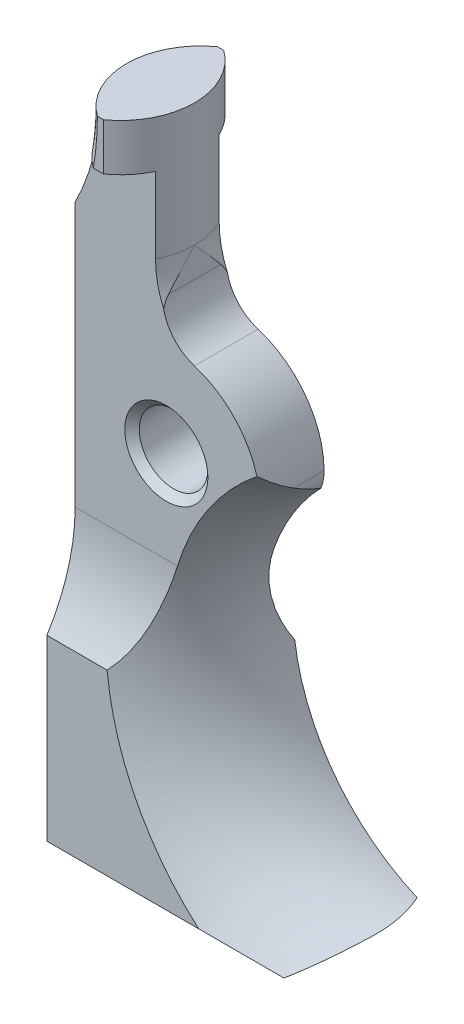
ISO-10303-21;
HEADER;
FILE_DESCRIPTION(('STEP AP214'),'2;1');
FILE_NAME('part.step','',(''),(''),'','','');
FILE_SCHEMA(('AUTOMOTIVE_DESIGN { 1 0 10303 214 1 1 1 1 }'));
ENDSEC;
DATA;
#1=APPLICATION_CONTEXT('core data for automotive mechanical design processes');
#2=APPLICATION_PROTOCOL_DEFINITION('international standard','automotive_design',2000,#1);
#3=PRODUCT_CONTEXT('',#1,'mechanical');
#4=PRODUCT('Part','Part','',(#3));
#5=PRODUCT_RELATED_PRODUCT_CATEGORY('part','',(#4));
#6=PRODUCT_DEFINITION_FORMATION('','',#4);
#7=PRODUCT_DEFINITION_CONTEXT('part definition',#1,'design');
#8=PRODUCT_DEFINITION('design','',#6,#7);
#9=PRODUCT_DEFINITION_SHAPE('','',#8);
#10=(LENGTH_UNIT() NAMED_UNIT(*) SI_UNIT(.MILLI.,.METRE.));
#11=(NAMED_UNIT(*) PLANE_ANGLE_UNIT() SI_UNIT($,.RADIAN.));
#12=(NAMED_UNIT(*) SI_UNIT($,.STERADIAN.) SOLID_ANGLE_UNIT());
#13=UNCERTAINTY_MEASURE_WITH_UNIT(LENGTH_MEASURE(1.E-05),#10,'distance_accuracy_value','');
#14=(GEOMETRIC_REPRESENTATION_CONTEXT(3) GLOBAL_UNCERTAINTY_ASSIGNED_CONTEXT((#13)) GLOBAL_UNIT_ASSIGNED_CONTEXT((#10,
#11,#12)) REPRESENTATION_CONTEXT('',''));
#15=CARTESIAN_POINT('',(0.,0.,0.));
#16=DIRECTION('',(0.,0.,1.));
#17=DIRECTION('',(1.,0.,0.));
#18=AXIS2_PLACEMENT_3D('',#15,#16,#17);
#19=CARTESIAN_POINT('',(1.4605,4.66627796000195,-2.1082));
#20=DIRECTION('',(0.,0.,-1.));
#21=DIRECTION('',(-1.,0.,0.));
#22=AXIS2_PLACEMENT_3D('',#19,#20,#21);
#23=PLANE('',#22);
#24=CARTESIAN_POINT('',(8.4582,-5.6896,-2.1082));
#25=DIRECTION('',(0.,0.,-1.));
#26=DIRECTION('',(-1.,0.,0.));
#27=AXIS2_PLACEMENT_3D('',#24,#25,#26);
#28=CIRCLE('',#27,7.239);
#29=CARTESIAN_POINT('',(5.57525167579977,-12.3297603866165,-2.1082));
#30=VERTEX_POINT('',#29);
#31=CARTESIAN_POINT('',(1.2812980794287,-6.63575,-2.1082));
#32=VERTEX_POINT('',#31);
#33=EDGE_CURVE('E581',#30,#32,#28,.T.);
#34=ORIENTED_EDGE('',*,*,#33,.F.);
#35=CARTESIAN_POINT('',(-2.667,-2.8448,-2.1082));
#36=DIRECTION('',(0.,0.,1.));
#37=DIRECTION('',(1.,0.,0.));
#38=AXIS2_PLACEMENT_3D('',#35,#36,#37);
#39=CIRCLE('',#38,12.5657942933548);
#40=CARTESIAN_POINT('',(1.58111212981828,-14.6707346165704,-2.1082));
#41=VERTEX_POINT('',#40);
#42=EDGE_CURVE('E480',#41,#30,#39,.T.);
#43=ORIENTED_EDGE('',*,*,#42,.F.);
#44=CARTESIAN_POINT('',(0.457200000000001,-11.1677486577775,-2.1082));
#45=DIRECTION('',(0.,0.,1.));
#46=DIRECTION('',(1.,0.,0.));
#47=AXIS2_PLACEMENT_3D('',#44,#45,#46);
#48=CIRCLE('',#47,3.67887062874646);
#49=CARTESIAN_POINT('',(-1.00155174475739,-14.5450452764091,-2.1082));
#50=VERTEX_POINT('',#49);
#51=EDGE_CURVE('E465',#50,#41,#48,.T.);
#52=ORIENTED_EDGE('',*,*,#51,.F.);
#53=CARTESIAN_POINT('',(3.5814,-2.8448,-2.1082));
#54=DIRECTION('',(0.,0.,-1.));
#55=DIRECTION('',(-1.,0.,0.));
#56=AXIS2_PLACEMENT_3D('',#53,#54,#55);
#57=CIRCLE('',#56,12.5657942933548);
#58=CARTESIAN_POINT('',(-3.2004,-13.4233809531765,-2.1082));
#59=VERTEX_POINT('',#58);
#60=EDGE_CURVE('E613',#50,#59,#57,.T.);
#61=ORIENTED_EDGE('',*,*,#60,.T.);
#62=DIRECTION('',(0.,-1.,0.));
#63=VECTOR('',#62,1.);
#64=CARTESIAN_POINT('',(-3.2004,6.64102994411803,-2.1082));
#65=LINE('',#64,#63);
#66=CARTESIAN_POINT('',(-3.2004,-6.63575,-2.1082));
#67=VERTEX_POINT('',#66);
#68=EDGE_CURVE('E585',#67,#59,#65,.T.);
#69=ORIENTED_EDGE('',*,*,#68,.F.);
#70=DIRECTION('',(-1.,0.,0.));
#71=VECTOR('',#70,1.);
#72=CARTESIAN_POINT('',(5.87172160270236,-6.63575,-2.1082));
#73=LINE('',#72,#71);
#74=EDGE_CURVE('E544',#32,#67,#73,.T.);
#75=ORIENTED_EDGE('',*,*,#74,.F.);
#76=EDGE_LOOP('',(#34,#43,#52,#61,#69,#75));
#77=FACE_BOUND('',#76,.T.);
#78=ADVANCED_FACE('F35',(#77),#23,.T.);
#79=CARTESIAN_POINT('',(3.5814,-2.8448,2.1082));
#80=DIRECTION('',(0.,0.,-1.));
#81=DIRECTION('',(-1.,0.,0.));
#82=AXIS2_PLACEMENT_3D('',#79,#80,#81);
#83=CYLINDRICAL_SURFACE('',#82,12.8524);
#84=CARTESIAN_POINT('',(3.5814,-2.8448,-0.4572));
#85=DIRECTION('',(0.,0.,-1.));
#86=DIRECTION('',(-1.,0.,0.));
#87=AXIS2_PLACEMENT_3D('',#84,#85,#86);
#88=CIRCLE('',#87,12.8524);
#89=CARTESIAN_POINT('',(-0.935300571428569,-14.8774057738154,-0.4572));
#90=VERTEX_POINT('',#89);
#91=CARTESIAN_POINT('',(-3.2004,-13.7622802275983,-0.4572));
#92=VERTEX_POINT('',#91);
#93=EDGE_CURVE('E466',#90,#92,#88,.T.);
#94=ORIENTED_EDGE('',*,*,#93,.F.);
#95=DIRECTION('',(0.,0.,-1.));
#96=VECTOR('',#95,1.);
#97=CARTESIAN_POINT('',(-0.935300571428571,-14.8774057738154,2.1082));
#98=LINE('',#97,#96);
#99=CARTESIAN_POINT('',(-0.935300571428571,-14.8774057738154,0.124324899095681));
#100=VERTEX_POINT('',#99);
#101=EDGE_CURVE('E499',#100,#90,#98,.T.);
#102=ORIENTED_EDGE('',*,*,#101,.F.);
#103=CARTESIAN_POINT('',(3.5814,-2.8448,12.156930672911));
#104=DIRECTION('',(0.,0.707106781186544,-0.707106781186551));
#105=DIRECTION('',(0.,-0.707106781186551,-0.707106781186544));
#106=AXIS2_PLACEMENT_3D('',#103,#104,#105);
#107=ELLIPSE('',#106,18.1760383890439,12.8524);
#108=CARTESIAN_POINT('',(-3.20040000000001,-13.7622802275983,1.23945044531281));
#109=VERTEX_POINT('',#108);
#110=EDGE_CURVE('E239',#100,#109,#107,.T.);
#111=ORIENTED_EDGE('',*,*,#110,.T.);
#112=DIRECTION('',(0.,0.,-1.));
#113=VECTOR('',#112,1.);
#114=CARTESIAN_POINT('',(-3.20040000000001,-13.7622802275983,2.1082));
#115=LINE('',#114,#113);
#116=EDGE_CURVE('E504',#109,#92,#115,.T.);
#117=ORIENTED_EDGE('',*,*,#116,.T.);
#118=EDGE_LOOP('',(#94,#102,#111,#117));
#119=FACE_BOUND('',#118,.T.);
#120=ADVANCED_FACE('F322',(#119),#83,.T.);
#121=CARTESIAN_POINT('',(0.457200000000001,-11.1677486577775,2.1082));
#122=DIRECTION('',(0.,0.,-1.));
#123=DIRECTION('',(-1.,0.,0.));
#124=AXIS2_PLACEMENT_3D('',#121,#122,#123);
#125=CYLINDRICAL_SURFACE('',#124,3.9624);
#126=ORIENTED_EDGE('',*,*,#101,.T.);
#127=CARTESIAN_POINT('',(0.457200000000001,-11.1677486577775,-0.4572));
#128=DIRECTION('',(0.,0.,1.));
#129=DIRECTION('',(1.,0.,0.));
#130=AXIS2_PLACEMENT_3D('',#127,#128,#129);
#131=CIRCLE('',#130,3.9624);
#132=CARTESIAN_POINT('',(0.457200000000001,-15.1301486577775,-0.4572));
#133=VERTEX_POINT('',#132);
#134=EDGE_CURVE('E478',#90,#133,#131,.T.);
#135=ORIENTED_EDGE('',*,*,#134,.T.);
#136=CARTESIAN_POINT('',(-0.880088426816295,-14.8976646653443,0.104066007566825));
#137=CARTESIAN_POINT('',(-0.825340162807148,-14.9172919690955,0.0844323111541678));
#138=CARTESIAN_POINT('',(-0.77041500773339,-14.935625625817,0.0640461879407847));
#139=CARTESIAN_POINT('',(-0.660272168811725,-14.9697475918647,0.0220101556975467));
#140=CARTESIAN_POINT('',(-0.605054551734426,-14.985536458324,0.000360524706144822));
#141=CARTESIAN_POINT('',(-0.439060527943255,-15.0291498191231,-0.0661189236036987));
#142=CARTESIAN_POINT('',(-0.327901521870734,-15.0532358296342,-0.112494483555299));
#143=CARTESIAN_POINT('',(-0.106440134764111,-15.09144536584,-0.207166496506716));
#144=CARTESIAN_POINT('',(0.00385534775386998,-15.1056908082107,-0.255431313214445));
#145=CARTESIAN_POINT('',(0.224683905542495,-15.124871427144,-0.353150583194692));
#146=CARTESIAN_POINT('',(0.335216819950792,-15.1298116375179,-0.402604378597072));
#147=CARTESIAN_POINT('',(0.449539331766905,-15.1301431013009,-0.453771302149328));
#148=CARTESIAN_POINT('',(0.453369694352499,-15.1301486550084,-0.455485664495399));
#149=CARTESIAN_POINT('',(0.457200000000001,-15.1301486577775,-0.4572));
#150=B_SPLINE_CURVE_WITH_KNOTS('',3,(#136,#137,#138,#139,#140,#141,#142,#143,#144,#145,#146,
#147,#148,#149),.UNSPECIFIED.,.F.,.F.,(4,2,2,2,2,2,4),(0.,0.184109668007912,0.368178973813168,
0.73617852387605,1.09953289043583,1.46269063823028,1.47528016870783),.UNSPECIFIED.);
#151=CARTESIAN_POINT('',(-0.880088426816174,-14.8976646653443,0.104066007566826));
#152=VERTEX_POINT('',#151);
#153=EDGE_CURVE('E438',#133,#152,#150,.F.);
#154=ORIENTED_EDGE('',*,*,#153,.T.);
#155=CARTESIAN_POINT('',(0.457200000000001,-11.1677486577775,3.83398201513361));
#156=DIRECTION('',(0.,0.707106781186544,-0.707106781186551));
#157=DIRECTION('',(0.,-0.707106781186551,-0.707106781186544));
#158=AXIS2_PLACEMENT_3D('',#155,#156,#157);
#159=ELLIPSE('',#158,5.60367981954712,3.9624);
#160=EDGE_CURVE('E231',#152,#100,#159,.T.);
#161=ORIENTED_EDGE('',*,*,#160,.T.);
#162=EDGE_LOOP('',(#126,#135,#154,#161));
#163=FACE_BOUND('',#162,.T.);
#164=ADVANCED_FACE('F435',(#163),#125,.T.);
#165=CARTESIAN_POINT('',(1.4605,4.66627796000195,2.1082));
#166=DIRECTION('',(0.,0.,-1.));
#167=DIRECTION('',(-1.,0.,0.));
#168=AXIS2_PLACEMENT_3D('',#165,#166,#167);
#169=CYLINDRICAL_SURFACE('',#168,1.5875);
#170=CARTESIAN_POINT('',(0.473489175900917,3.42290919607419,1.15559330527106));
#171=CARTESIAN_POINT('',(0.449711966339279,3.44178026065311,1.16604117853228));
#172=CARTESIAN_POINT('',(0.426223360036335,3.46154274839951,1.17548765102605));
#173=CARTESIAN_POINT('',(0.380046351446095,3.50277737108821,1.19239429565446));
#174=CARTESIAN_POINT('',(0.357357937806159,3.52424948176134,1.19985449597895));
#175=CARTESIAN_POINT('',(0.290890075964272,3.59105736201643,1.21926226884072));
#176=CARTESIAN_POINT('',(0.248638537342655,3.63883922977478,1.22826687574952));
#177=CARTESIAN_POINT('',(0.17029308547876,3.73916327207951,1.23841554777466));
#178=CARTESIAN_POINT('',(0.134143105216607,3.79165444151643,1.23963546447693));
#179=CARTESIAN_POINT('',(0.0685752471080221,3.9003010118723,1.23444081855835));
#180=CARTESIAN_POINT('',(0.0391530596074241,3.95645403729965,1.22803115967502));
#181=CARTESIAN_POINT('',(-0.0109935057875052,4.06762571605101,1.2080689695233));
#182=CARTESIAN_POINT('',(-0.0320974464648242,4.12254569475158,1.19491473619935));
#183=CARTESIAN_POINT('',(-0.0676696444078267,4.23246678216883,1.1616160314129));
#184=CARTESIAN_POINT('',(-0.0821328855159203,4.28746792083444,1.14146629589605));
#185=CARTESIAN_POINT('',(-0.105485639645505,4.39923289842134,1.09259322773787));
#186=CARTESIAN_POINT('',(-0.113951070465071,4.45587843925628,1.06339719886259));
#187=CARTESIAN_POINT('',(-0.124702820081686,4.56488858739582,0.99716691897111));
#188=CARTESIAN_POINT('',(-0.127004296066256,4.61726338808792,0.960152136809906));
#189=CARTESIAN_POINT('',(-0.126999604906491,4.67084690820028,0.915875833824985));
#190=CARTESIAN_POINT('',(-0.126981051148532,4.67519095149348,0.912236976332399));
#191=CARTESIAN_POINT('',(-0.126944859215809,4.67950932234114,0.908569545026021));
#192=B_SPLINE_CURVE_WITH_KNOTS('',3,(#170,#171,#172,#173,#174,#175,#176,#177,#178,#179,#180,
#181,#182,#183,#184,#185,#186,#187,#188,#189,#190,#191),.UNSPECIFIED.,.F.,.F.,(4,2,2,2,2,2,2,2,
2,2,4),(0.,0.0962498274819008,0.192498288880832,0.384719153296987,0.575064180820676,
0.76528693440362,0.945386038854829,1.12562096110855,1.31758765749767,1.50908187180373,
1.52608147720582),.UNSPECIFIED.);
#193=CARTESIAN_POINT('',(-0.0935366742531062,4.34204615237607,1.11759999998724));
#194=VERTEX_POINT('',#193);
#195=CARTESIAN_POINT('',(-0.127000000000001,4.66627796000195,0.919651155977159));
#196=VERTEX_POINT('',#195);
#197=EDGE_CURVE('E299',#194,#196,#192,.T.);
#198=ORIENTED_EDGE('',*,*,#197,.F.);
#199=CARTESIAN_POINT('',(1.4605,4.66627796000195,1.1176));
#200=DIRECTION('',(0.,0.,-1.));
#201=DIRECTION('',(0.,1.,0.));
#202=AXIS2_PLACEMENT_3D('',#199,#200,#201);
#203=CIRCLE('',#202,1.5875);
#204=CARTESIAN_POINT('',(0.986311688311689,3.15125264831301,1.1176));
#205=VERTEX_POINT('',#204);
#206=EDGE_CURVE('E576',#194,#205,#203,.F.);
#207=ORIENTED_EDGE('',*,*,#206,.T.);
#208=DIRECTION('',(0.,0.,-1.));
#209=VECTOR('',#208,1.);
#210=CARTESIAN_POINT('',(0.986311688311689,3.15125264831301,2.1082));
#211=LINE('',#210,#209);
#212=CARTESIAN_POINT('',(0.986311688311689,3.15125264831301,-1.1176));
#213=VERTEX_POINT('',#212);
#214=EDGE_CURVE('E583',#205,#213,#211,.T.);
#215=ORIENTED_EDGE('',*,*,#214,.T.);
#216=CARTESIAN_POINT('',(1.4605,4.66627796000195,-1.1176));
#217=DIRECTION('',(0.,0.,1.));
#218=DIRECTION('',(0.,-1.,0.));
#219=AXIS2_PLACEMENT_3D('',#216,#217,#218);
#220=CIRCLE('',#219,1.5875);
#221=CARTESIAN_POINT('',(-0.0935366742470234,4.34204615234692,-1.1176));
#222=VERTEX_POINT('',#221);
#223=EDGE_CURVE('E557',#213,#222,#220,.F.);
#224=ORIENTED_EDGE('',*,*,#223,.T.);
#225=CARTESIAN_POINT('',(-0.126944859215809,4.67950932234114,-0.90856954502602));
#226=CARTESIAN_POINT('',(-0.126981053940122,4.67519095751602,-0.912236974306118));
#227=CARTESIAN_POINT('',(-0.126999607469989,4.67084691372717,-0.915875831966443));
#228=CARTESIAN_POINT('',(-0.127004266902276,4.61726662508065,-0.960149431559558));
#229=CARTESIAN_POINT('',(-0.124702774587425,4.56489484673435,-0.997162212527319));
#230=CARTESIAN_POINT('',(-0.11395256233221,4.4558868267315,-1.06339301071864));
#231=CARTESIAN_POINT('',(-0.105487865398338,4.39923984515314,-1.09259049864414));
#232=CARTESIAN_POINT('',(-0.0815310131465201,4.28459105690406,-1.14272399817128));
#233=CARTESIAN_POINT('',(-0.0661195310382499,4.22661185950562,-1.16374982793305));
#234=CARTESIAN_POINT('',(-0.0279097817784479,4.11084444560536,-1.19804005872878));
#235=CARTESIAN_POINT('',(-0.00511694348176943,4.05305612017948,-1.21131014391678));
#236=CARTESIAN_POINT('',(0.0477219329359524,3.93954936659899,-1.23021747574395));
#237=CARTESIAN_POINT('',(0.0777711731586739,3.88383186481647,-1.2358513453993));
#238=CARTESIAN_POINT('',(0.144468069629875,3.77620637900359,-1.23953380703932));
#239=CARTESIAN_POINT('',(0.181118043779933,3.72429974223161,-1.23757972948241));
#240=CARTESIAN_POINT('',(0.258532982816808,3.62746405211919,-1.2262530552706));
#241=CARTESIAN_POINT('',(0.299109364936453,3.58235453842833,-1.21714211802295));
#242=CARTESIAN_POINT('',(0.362717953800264,3.51913774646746,-1.19811546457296));
#243=CARTESIAN_POINT('',(0.384390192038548,3.49879726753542,-1.19087468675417));
#244=CARTESIAN_POINT('',(0.428451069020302,3.45967109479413,-1.1745899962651));
#245=CARTESIAN_POINT('',(0.450839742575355,3.44088547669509,-1.16554599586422));
#246=CARTESIAN_POINT('',(0.473489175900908,3.4229091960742,-1.15559330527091));
#247=B_SPLINE_CURVE_WITH_KNOTS('',3,(#225,#226,#227,#228,#229,#230,#231,#232,#233,#234,#235,
#236,#237,#238,#239,#240,#241,#242,#243,#244,#245,#246),.UNSPECIFIED.,.F.,.F.,(4,2,2,2,2,2,2,2,
2,2,4),(0.,0.0169996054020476,0.208480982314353,0.400460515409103,0.590265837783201,
0.779931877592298,0.969681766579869,1.15949841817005,1.34268109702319,1.43436827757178,
1.52605991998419),.UNSPECIFIED.);
#248=CARTESIAN_POINT('',(-0.127,4.66627796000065,-0.919651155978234));
#249=VERTEX_POINT('',#248);
#250=EDGE_CURVE('E264',#249,#222,#247,.T.);
#251=ORIENTED_EDGE('',*,*,#250,.F.);
#252=DIRECTION('',(0.,0.,-1.));
#253=VECTOR('',#252,1.);
#254=CARTESIAN_POINT('',(-0.127000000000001,4.66627796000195,2.1082));
#255=LINE('',#254,#253);
#256=EDGE_CURVE('E506',#196,#249,#255,.T.);
#257=ORIENTED_EDGE('',*,*,#256,.F.);
#258=EDGE_LOOP('',(#198,#207,#215,#224,#251,#257));
#259=FACE_BOUND('',#258,.T.);
#260=ADVANCED_FACE('F277',(#259),#169,.F.);
#261=CARTESIAN_POINT('',(-0.127000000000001,10.033,2.1082));
#262=DIRECTION('',(-1.,0.,0.));
#263=DIRECTION('',(0.,-1.,0.));
#264=AXIS2_PLACEMENT_3D('',#261,#262,#263);
#265=PLANE('',#264);
#266=CARTESIAN_POINT('',(-0.127000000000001,5.715,0.));
#267=CARTESIAN_POINT('',(-0.127000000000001,5.71221244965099,-0.00251806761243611));
#268=CARTESIAN_POINT('',(-0.127000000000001,5.70942489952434,-0.00503613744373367));
#269=CARTESIAN_POINT('',(-0.126999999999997,5.3735346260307,-0.308453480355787));
#270=CARTESIAN_POINT('',(-0.127,5.04033210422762,-0.609268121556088));
#271=CARTESIAN_POINT('',(-0.127000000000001,4.35064555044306,-1.18165854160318));
#272=CARTESIAN_POINT('',(-0.127000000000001,3.99427109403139,-1.45335784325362));
#273=CARTESIAN_POINT('',(-0.127,3.37313647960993,-1.84956662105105));
#274=CARTESIAN_POINT('',(-0.127,3.12038926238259,-1.99219315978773));
#275=CARTESIAN_POINT('',(-0.127,2.59373089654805,-2.24113663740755));
#276=CARTESIAN_POINT('',(-0.127,2.31958127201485,-2.34694068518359));
#277=CARTESIAN_POINT('',(-0.127,2.03619772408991,-2.42709008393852));
#278=B_SPLINE_CURVE_WITH_KNOTS('',3,(#266,#267,#268,#269,#270,#271,#272,#273,#274,#275,#276,
#277),.UNSPECIFIED.,.F.,.F.,(4,2,2,2,2,4),(0.,0.0112694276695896,1.35792415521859,
2.69861836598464,3.56650606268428,4.44603929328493),.UNSPECIFIED.);
#279=CARTESIAN_POINT('',(-0.127000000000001,5.715,0.));
#280=VERTEX_POINT('',#279);
#281=EDGE_CURVE('E271',#280,#249,#278,.T.);
#282=ORIENTED_EDGE('',*,*,#281,.F.);
#283=CARTESIAN_POINT('',(-0.127000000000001,5.715,0.));
#284=CARTESIAN_POINT('',(-0.127000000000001,5.71221244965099,0.00251806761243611));
#285=CARTESIAN_POINT('',(-0.127000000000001,5.70942489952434,0.00503613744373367));
#286=CARTESIAN_POINT('',(-0.126999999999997,5.3735346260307,0.308453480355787));
#287=CARTESIAN_POINT('',(-0.127,5.04033210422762,0.609268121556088));
#288=CARTESIAN_POINT('',(-0.127000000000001,4.35064555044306,1.18165854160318));
#289=CARTESIAN_POINT('',(-0.127000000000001,3.99427109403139,1.45335784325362));
#290=CARTESIAN_POINT('',(-0.127,3.37313647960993,1.84956662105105));
#291=CARTESIAN_POINT('',(-0.127,3.12038926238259,1.99219315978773));
#292=CARTESIAN_POINT('',(-0.127,2.59373089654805,2.24113663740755));
#293=CARTESIAN_POINT('',(-0.127,2.31958127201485,2.34694068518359));
#294=CARTESIAN_POINT('',(-0.127,2.03619772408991,2.42709008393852));
#295=B_SPLINE_CURVE_WITH_KNOTS('',3,(#283,#284,#285,#286,#287,#288,#289,#290,#291,#292,#293,
#294),.UNSPECIFIED.,.F.,.F.,(4,2,2,2,2,4),(0.,0.0112694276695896,1.35792415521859,
2.69861836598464,3.56650606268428,4.44603929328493),.UNSPECIFIED.);
#296=EDGE_CURVE('E295',#196,#280,#295,.F.);
#297=ORIENTED_EDGE('',*,*,#296,.F.);
#298=ORIENTED_EDGE('',*,*,#256,.T.);
#299=EDGE_LOOP('',(#282,#297,#298));
#300=FACE_BOUND('',#299,.T.);
#301=ADVANCED_FACE('F304',(#300),#265,.F.);
#302=CARTESIAN_POINT('',(5.87172160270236,8.382,1.1176));
#303=DIRECTION('',(0.,0.,-1.));
#304=DIRECTION('',(0.,1.,0.));
#305=AXIS2_PLACEMENT_3D('',#302,#303,#304);
#306=PLANE('',#305);
#307=CARTESIAN_POINT('',(0.,0.,1.1176));
#308=DIRECTION('',(0.,0.,-1.));
#309=DIRECTION('',(0.,1.,0.));
#310=AXIS2_PLACEMENT_3D('',#307,#308,#309);
#311=CIRCLE('',#310,1.45795999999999);
#312=CARTESIAN_POINT('',(0.,1.45795999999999,1.1176));
#313=VERTEX_POINT('',#312);
#314=EDGE_CURVE('E11',#313,#313,#311,.T.);
#315=ORIENTED_EDGE('',*,*,#314,.T.);
#316=EDGE_LOOP('',(#315));
#317=FACE_BOUND('',#316,.T.);
#318=DIRECTION('',(-1.,0.,0.));
#319=VECTOR('',#318,1.);
#320=CARTESIAN_POINT('',(5.87172160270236,-3.22997084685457,1.1176));
#321=LINE('',#320,#319);
#322=CARTESIAN_POINT('',(0.391359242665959,-3.22997084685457,1.1176));
#323=VERTEX_POINT('',#322);
#324=CARTESIAN_POINT('',(-3.2004,-3.22997084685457,1.1176));
#325=VERTEX_POINT('',#324);
#326=EDGE_CURVE('E565',#323,#325,#321,.T.);
#327=ORIENTED_EDGE('',*,*,#326,.F.);
#328=CARTESIAN_POINT('',(8.4582,-5.6896,1.1176));
#329=DIRECTION('',(0.,0.,1.));
#330=DIRECTION('',(0.,-1.,0.));
#331=AXIS2_PLACEMENT_3D('',#328,#329,#330);
#332=CIRCLE('',#331,8.43348654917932);
#333=CARTESIAN_POINT('',(3.18029932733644,0.888200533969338,1.11760000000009));
#334=VERTEX_POINT('',#333);
#335=EDGE_CURVE('E370',#323,#334,#332,.F.);
#336=ORIENTED_EDGE('',*,*,#335,.T.);
#337=CARTESIAN_POINT('',(0.,0.,1.1176));
#338=DIRECTION('',(0.,0.,-1.));
#339=DIRECTION('',(0.,1.,0.));
#340=AXIS2_PLACEMENT_3D('',#337,#338,#339);
#341=CIRCLE('',#340,3.302);
#342=EDGE_CURVE('E568',#205,#334,#341,.T.);
#343=ORIENTED_EDGE('',*,*,#342,.F.);
#344=ORIENTED_EDGE('',*,*,#206,.F.);
#345=CARTESIAN_POINT('',(3.048,5.715,1.1176));
#346=DIRECTION('',(0.,0.,1.));
#347=DIRECTION('',(0.,-1.,0.));
#348=AXIS2_PLACEMENT_3D('',#345,#346,#347);
#349=CIRCLE('',#348,3.42844789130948);
#350=CARTESIAN_POINT('',(-0.380447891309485,5.715,1.1176));
#351=VERTEX_POINT('',#350);
#352=EDGE_CURVE('E648',#351,#194,#349,.T.);
#353=ORIENTED_EDGE('',*,*,#352,.F.);
#354=DIRECTION('',(0.,1.,0.));
#355=VECTOR('',#354,1.);
#356=CARTESIAN_POINT('',(-0.380447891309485,5.715,1.1176));
#357=LINE('',#356,#355);
#358=CARTESIAN_POINT('',(-0.380447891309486,8.382,1.1176));
#359=VERTEX_POINT('',#358);
#360=EDGE_CURVE('E258',#351,#359,#357,.T.);
#361=ORIENTED_EDGE('',*,*,#360,.T.);
#362=DIRECTION('',(-1.,0.,0.));
#363=VECTOR('',#362,1.);
#364=CARTESIAN_POINT('',(5.87172160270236,8.382,1.1176));
#365=LINE('',#364,#363);
#366=CARTESIAN_POINT('',(-2.41414601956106,8.382,1.1176));
#367=VERTEX_POINT('',#366);
#368=EDGE_CURVE('E566',#359,#367,#365,.T.);
#369=ORIENTED_EDGE('',*,*,#368,.T.);
#370=CARTESIAN_POINT('',(-11.24585,10.033,1.1176));
#371=DIRECTION('',(0.,0.,1.));
#372=DIRECTION('',(0.,-1.,0.));
#373=AXIS2_PLACEMENT_3D('',#370,#371,#372);
#374=CIRCLE('',#373,8.98469789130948);
#375=CARTESIAN_POINT('',(-3.2004,6.03355872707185,1.1176));
#376=VERTEX_POINT('',#375);
#377=EDGE_CURVE('E330',#367,#376,#374,.F.);
#378=ORIENTED_EDGE('',*,*,#377,.T.);
#379=DIRECTION('',(0.,-1.,0.));
#380=VECTOR('',#379,1.);
#381=CARTESIAN_POINT('',(-3.2004,8.382,1.1176));
#382=LINE('',#381,#380);
#383=EDGE_CURVE('E559',#376,#325,#382,.T.);
#384=ORIENTED_EDGE('',*,*,#383,.T.);
#385=EDGE_LOOP('',(#327,#336,#343,#344,#353,#361,#369,#378,#384));
#386=FACE_BOUND('',#385,.T.);
#387=ADVANCED_FACE('F308',(#317,#386),#306,.F.);
#388=CARTESIAN_POINT('',(5.87172160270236,8.382,-1.1176));
#389=DIRECTION('',(0.,0.,1.));
#390=DIRECTION('',(0.,-1.,0.));
#391=AXIS2_PLACEMENT_3D('',#388,#389,#390);
#392=PLANE('',#391);
#393=CARTESIAN_POINT('',(0.,0.,-1.1176));
#394=DIRECTION('',(0.,0.,1.));
#395=DIRECTION('',(0.,-1.,0.));
#396=AXIS2_PLACEMENT_3D('',#393,#394,#395);
#397=CIRCLE('',#396,1.45796);
#398=CARTESIAN_POINT('',(0.,-1.45796,-1.1176));
#399=VERTEX_POINT('',#398);
#400=EDGE_CURVE('E659',#399,#399,#397,.T.);
#401=ORIENTED_EDGE('',*,*,#400,.T.);
#402=EDGE_LOOP('',(#401));
#403=FACE_BOUND('',#402,.T.);
#404=CARTESIAN_POINT('',(1.71449244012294,0.00509144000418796,-1.1176));
#405=DIRECTION('',(0.,0.,1.));
#406=DIRECTION('',(0.,-1.,0.));
#407=AXIS2_PLACEMENT_3D('',#404,#405,#406);
#408=CIRCLE('',#407,1.5875);
#409=CARTESIAN_POINT('',(3.19040323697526,-0.579582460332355,-1.1176));
#410=VERTEX_POINT('',#409);
#411=CARTESIAN_POINT('',(3.30198544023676,0.00980573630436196,-1.1176));
#412=VERTEX_POINT('',#411);
#413=EDGE_CURVE('E555',#410,#412,#408,.T.);
#414=ORIENTED_EDGE('',*,*,#413,.F.);
#415=CARTESIAN_POINT('',(8.4582,-5.6896,-1.1176));
#416=DIRECTION('',(0.,0.,-1.));
#417=DIRECTION('',(0.,1.,0.));
#418=AXIS2_PLACEMENT_3D('',#415,#416,#417);
#419=CIRCLE('',#418,7.33907092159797);
#420=CARTESIAN_POINT('',(1.54356433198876,-3.22997084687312,-1.1176));
#421=VERTEX_POINT('',#420);
#422=EDGE_CURVE('E882',#410,#421,#419,.F.);
#423=ORIENTED_EDGE('',*,*,#422,.T.);
#424=DIRECTION('',(-1.,0.,0.));
#425=VECTOR('',#424,1.);
#426=CARTESIAN_POINT('',(5.87172160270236,-3.22997084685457,-1.1176));
#427=LINE('',#426,#425);
#428=CARTESIAN_POINT('',(-3.2004,-3.22997084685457,-1.1176));
#429=VERTEX_POINT('',#428);
#430=EDGE_CURVE('E548',#421,#429,#427,.T.);
#431=ORIENTED_EDGE('',*,*,#430,.T.);
#432=DIRECTION('',(0.,1.,0.));
#433=VECTOR('',#432,1.);
#434=CARTESIAN_POINT('',(-3.2004,8.382,-1.1176));
#435=LINE('',#434,#433);
#436=CARTESIAN_POINT('',(-3.2004,6.03355872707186,-1.1176));
#437=VERTEX_POINT('',#436);
#438=EDGE_CURVE('E552',#429,#437,#435,.T.);
#439=ORIENTED_EDGE('',*,*,#438,.T.);
#440=CARTESIAN_POINT('',(-11.24585,10.033,-1.1176));
#441=DIRECTION('',(0.,0.,-1.));
#442=DIRECTION('',(0.,1.,0.));
#443=AXIS2_PLACEMENT_3D('',#440,#441,#442);
#444=CIRCLE('',#443,8.98469789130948);
#445=CARTESIAN_POINT('',(-2.41414601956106,8.382,-1.1176));
#446=VERTEX_POINT('',#445);
#447=EDGE_CURVE('E514',#437,#446,#444,.F.);
#448=ORIENTED_EDGE('',*,*,#447,.T.);
#449=DIRECTION('',(-1.,0.,0.));
#450=VECTOR('',#449,1.);
#451=CARTESIAN_POINT('',(5.87172160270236,8.382,-1.1176));
#452=LINE('',#451,#450);
#453=CARTESIAN_POINT('',(-0.380447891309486,8.382,-1.1176));
#454=VERTEX_POINT('',#453);
#455=EDGE_CURVE('E532',#454,#446,#452,.T.);
#456=ORIENTED_EDGE('',*,*,#455,.F.);
#457=DIRECTION('',(0.,1.,0.));
#458=VECTOR('',#457,1.);
#459=CARTESIAN_POINT('',(-0.380447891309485,5.715,-1.1176));
#460=LINE('',#459,#458);
#461=CARTESIAN_POINT('',(-0.380447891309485,5.715,-1.1176));
#462=VERTEX_POINT('',#461);
#463=EDGE_CURVE('E517',#454,#462,#460,.F.);
#464=ORIENTED_EDGE('',*,*,#463,.T.);
#465=CARTESIAN_POINT('',(3.048,5.715,-1.1176));
#466=DIRECTION('',(0.,0.,-1.));
#467=DIRECTION('',(0.,1.,0.));
#468=AXIS2_PLACEMENT_3D('',#465,#466,#467);
#469=CIRCLE('',#468,3.42844789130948);
#470=EDGE_CURVE('E520',#222,#462,#469,.T.);
#471=ORIENTED_EDGE('',*,*,#470,.F.);
#472=ORIENTED_EDGE('',*,*,#223,.F.);
#473=CARTESIAN_POINT('',(0.,0.,-1.1176));
#474=DIRECTION('',(0.,0.,1.));
#475=DIRECTION('',(0.,-1.,0.));
#476=AXIS2_PLACEMENT_3D('',#473,#474,#475);
#477=CIRCLE('',#476,3.302);
#478=EDGE_CURVE('E546',#412,#213,#477,.T.);
#479=ORIENTED_EDGE('',*,*,#478,.F.);
#480=EDGE_LOOP('',(#414,#423,#431,#439,#448,#456,#464,#471,#472,#479));
#481=FACE_BOUND('',#480,.T.);
#482=ADVANCED_FACE('F531',(#403,#481),#392,.F.);
#483=CARTESIAN_POINT('',(1.4605,4.66627796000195,2.1082));
#484=DIRECTION('',(0.,0.,-1.));
#485=DIRECTION('',(-1.,0.,0.));
#486=AXIS2_PLACEMENT_3D('',#483,#484,#485);
#487=PLANE('',#486);
#488=DIRECTION('',(-1.,0.,0.));
#489=VECTOR('',#488,1.);
#490=CARTESIAN_POINT('',(5.87172160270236,8.382,2.1082));
#491=LINE('',#490,#489);
#492=CARTESIAN_POINT('',(-1.21189914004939,8.382,2.1082));
#493=VERTEX_POINT('',#492);
#494=CARTESIAN_POINT('',(-1.56953960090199,8.382,2.1082));
#495=VERTEX_POINT('',#494);
#496=EDGE_CURVE('E569',#493,#495,#491,.T.);
#497=ORIENTED_EDGE('',*,*,#496,.F.);
#498=DIRECTION('',(0.,1.,0.));
#499=VECTOR('',#498,1.);
#500=CARTESIAN_POINT('',(-1.21189914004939,5.715,2.1082));
#501=LINE('',#500,#499);
#502=CARTESIAN_POINT('',(-1.21189914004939,10.033,2.1082));
#503=VERTEX_POINT('',#502);
#504=EDGE_CURVE('E253',#493,#503,#501,.T.);
#505=ORIENTED_EDGE('',*,*,#504,.T.);
#506=DIRECTION('',(-1.,0.,0.));
#507=VECTOR('',#506,1.);
#508=CARTESIAN_POINT('',(-2.5146,10.033,2.1082));
#509=LINE('',#508,#507);
#510=CARTESIAN_POINT('',(-1.42970085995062,10.033,2.1082));
#511=VERTEX_POINT('',#510);
#512=EDGE_CURVE('E579',#503,#511,#509,.T.);
#513=ORIENTED_EDGE('',*,*,#512,.T.);
#514=CARTESIAN_POINT('',(-11.24585,10.033,2.1082));
#515=DIRECTION('',(0.,0.,1.));
#516=DIRECTION('',(1.,0.,0.));
#517=AXIS2_PLACEMENT_3D('',#514,#515,#516);
#518=CIRCLE('',#517,9.81614914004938);
#519=EDGE_CURVE('E641',#495,#511,#518,.T.);
#520=ORIENTED_EDGE('',*,*,#519,.F.);
#521=EDGE_LOOP('',(#497,#505,#513,#520));
#522=FACE_BOUND('',#521,.T.);
#523=ADVANCED_FACE('F630',(#522),#487,.F.);
#524=DIRECTION('',(1.,0.,0.));
#525=VECTOR('',#524,1.);
#526=CARTESIAN_POINT('',(-5.9182,-12.8935306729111,2.1082));
#527=LINE('',#526,#525);
#528=CARTESIAN_POINT('',(-3.2004,-12.8935306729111,2.1082));
#529=VERTEX_POINT('',#528);
#530=CARTESIAN_POINT('',(2.12327112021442,-12.8935306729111,2.1082));
#531=VERTEX_POINT('',#530);
#532=EDGE_CURVE('E219',#529,#531,#527,.T.);
#533=ORIENTED_EDGE('',*,*,#532,.T.);
#534=CARTESIAN_POINT('',(8.4582,-5.6896,2.1082));
#535=DIRECTION('',(0.,0.,-1.));
#536=DIRECTION('',(-1.,0.,0.));
#537=AXIS2_PLACEMENT_3D('',#534,#535,#536);
#538=CIRCLE('',#537,9.59311946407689);
#539=CARTESIAN_POINT('',(-1.088147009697,-6.63575,2.1082));
#540=VERTEX_POINT('',#539);
#541=EDGE_CURVE('E207',#531,#540,#538,.T.);
#542=ORIENTED_EDGE('',*,*,#541,.T.);
#543=DIRECTION('',(-1.,0.,0.));
#544=VECTOR('',#543,1.);
#545=CARTESIAN_POINT('',(5.87172160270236,-6.63575,2.1082));
#546=LINE('',#545,#544);
#547=CARTESIAN_POINT('',(-3.2004,-6.63575,2.1082));
#548=VERTEX_POINT('',#547);
#549=EDGE_CURVE('E571',#540,#548,#546,.T.);
#550=ORIENTED_EDGE('',*,*,#549,.T.);
#551=DIRECTION('',(0.,-1.,0.));
#552=VECTOR('',#551,1.);
#553=CARTESIAN_POINT('',(-3.2004,6.64102994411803,2.1082));
#554=LINE('',#553,#552);
#555=EDGE_CURVE('E226',#548,#529,#554,.T.);
#556=ORIENTED_EDGE('',*,*,#555,.T.);
#557=EDGE_LOOP('',(#533,#542,#550,#556));
#558=FACE_BOUND('',#557,.T.);
#559=ADVANCED_FACE('F224',(#558),#487,.F.);
#560=DIRECTION('',(0.,1.,0.));
#561=VECTOR('',#560,1.);
#562=CARTESIAN_POINT('',(-1.21189914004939,5.715,-2.1082));
#563=LINE('',#562,#561);
#564=CARTESIAN_POINT('',(-1.21189914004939,8.382,-2.1082));
#565=VERTEX_POINT('',#564);
#566=CARTESIAN_POINT('',(-1.21189914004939,10.033,-2.1082));
#567=VERTEX_POINT('',#566);
#568=EDGE_CURVE('E250',#565,#567,#563,.T.);
#569=ORIENTED_EDGE('',*,*,#568,.F.);
#570=DIRECTION('',(-1.,0.,0.));
#571=VECTOR('',#570,1.);
#572=CARTESIAN_POINT('',(5.87172160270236,8.382,-2.1082));
#573=LINE('',#572,#571);
#574=CARTESIAN_POINT('',(-1.56953960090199,8.382,-2.1082));
#575=VERTEX_POINT('',#574);
#576=EDGE_CURVE('E540',#565,#575,#573,.T.);
#577=ORIENTED_EDGE('',*,*,#576,.T.);
#578=CARTESIAN_POINT('',(-11.24585,10.033,-2.1082));
#579=DIRECTION('',(0.,0.,1.));
#580=DIRECTION('',(1.,0.,0.));
#581=AXIS2_PLACEMENT_3D('',#578,#579,#580);
#582=CIRCLE('',#581,9.81614914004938);
#583=CARTESIAN_POINT('',(-1.42970085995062,10.033,-2.1082));
#584=VERTEX_POINT('',#583);
#585=EDGE_CURVE('E645',#575,#584,#582,.T.);
#586=ORIENTED_EDGE('',*,*,#585,.T.);
#587=DIRECTION('',(-1.,0.,0.));
#588=VECTOR('',#587,1.);
#589=CARTESIAN_POINT('',(-2.5146,10.033,-2.1082));
#590=LINE('',#589,#588);
#591=EDGE_CURVE('E578',#567,#584,#590,.T.);
#592=ORIENTED_EDGE('',*,*,#591,.F.);
#593=EDGE_LOOP('',(#569,#577,#586,#592));
#594=FACE_BOUND('',#593,.T.);
#595=ADVANCED_FACE('F315',(#594),#23,.T.);
#596=CARTESIAN_POINT('',(-2.5146,10.033,2.1082));
#597=DIRECTION('',(0.,-1.,0.));
#598=DIRECTION('',(0.,0.,-1.));
#599=AXIS2_PLACEMENT_3D('',#596,#597,#598);
#600=PLANE('',#599);
#601=ORIENTED_EDGE('',*,*,#512,.F.);
#602=CARTESIAN_POINT('',(-2.7178,10.033,0.));
#603=DIRECTION('',(0.,-1.,0.));
#604=DIRECTION('',(0.,0.,-1.));
#605=AXIS2_PLACEMENT_3D('',#602,#603,#604);
#606=CIRCLE('',#605,2.5908);
#607=EDGE_CURVE('E244',#567,#503,#606,.T.);
#608=ORIENTED_EDGE('',*,*,#607,.F.);
#609=ORIENTED_EDGE('',*,*,#591,.T.);
#610=CARTESIAN_POINT('',(0.0761999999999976,10.033,0.));
#611=DIRECTION('',(0.,-1.,0.));
#612=DIRECTION('',(0.,0.,-1.));
#613=AXIS2_PLACEMENT_3D('',#610,#611,#612);
#614=CIRCLE('',#613,2.5908);
#615=EDGE_CURVE('E636',#511,#584,#614,.T.);
#616=ORIENTED_EDGE('',*,*,#615,.F.);
#617=EDGE_LOOP('',(#601,#608,#609,#616));
#618=FACE_BOUND('',#617,.T.);
#619=ADVANCED_FACE('F310',(#618),#600,.F.);
#620=CARTESIAN_POINT('',(-3.2004,6.64102994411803,2.1082));
#621=DIRECTION('',(1.,0.,0.));
#622=DIRECTION('',(0.,1.,0.));
#623=AXIS2_PLACEMENT_3D('',#620,#621,#622);
#624=PLANE('',#623);
#625=ORIENTED_EDGE('',*,*,#68,.T.);
#626=CARTESIAN_POINT('',(-3.2004,-9.5712802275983,-0.457200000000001));
#627=DIRECTION('',(1.,0.,0.));
#628=DIRECTION('',(0.,1.,0.));
#629=AXIS2_PLACEMENT_3D('',#626,#627,#628);
#630=CIRCLE('',#629,4.191);
#631=EDGE_CURVE('E369',#92,#59,#630,.T.);
#632=ORIENTED_EDGE('',*,*,#631,.F.);
#633=ORIENTED_EDGE('',*,*,#116,.F.);
#634=DIRECTION('',(0.,0.707106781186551,0.707106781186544));
#635=VECTOR('',#634,1.);
#636=CARTESIAN_POINT('',(-3.2004,-3.12625036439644,11.8754803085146));
#637=LINE('',#636,#635);
#638=EDGE_CURVE('E242',#109,#529,#637,.T.);
#639=ORIENTED_EDGE('',*,*,#638,.T.);
#640=ORIENTED_EDGE('',*,*,#555,.F.);
#641=CARTESIAN_POINT('',(-3.2004,-3.22997084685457,7.4676));
#642=DIRECTION('',(-1.,0.,0.));
#643=DIRECTION('',(0.,1.,0.));
#644=AXIS2_PLACEMENT_3D('',#641,#642,#643);
#645=CIRCLE('',#644,6.35);
#646=EDGE_CURVE('E562',#325,#548,#645,.T.);
#647=ORIENTED_EDGE('',*,*,#646,.F.);
#648=ORIENTED_EDGE('',*,*,#383,.F.);
#649=CARTESIAN_POINT('',(-3.2004,4.93444233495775,-1.86618708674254));
#650=CARTESIAN_POINT('',(-3.2004,4.76746907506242,-1.95226365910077));
#651=CARTESIAN_POINT('',(-3.2004,4.59665177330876,-2.0310157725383));
#652=CARTESIAN_POINT('',(-3.2004,4.24899279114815,-2.17417142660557));
#653=CARTESIAN_POINT('',(-3.2004,4.07214596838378,-2.23856234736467));
#654=CARTESIAN_POINT('',(-3.2004,3.71319930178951,-2.35252260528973));
#655=CARTESIAN_POINT('',(-3.2004,3.53108706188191,-2.40205320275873));
#656=CARTESIAN_POINT('',(-3.2004,3.16333358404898,-2.48488929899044));
#657=CARTESIAN_POINT('',(-3.2004,2.97769462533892,-2.51820492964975));
#658=CARTESIAN_POINT('',(-3.2004,2.52464450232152,-2.57747625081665));
#659=CARTESIAN_POINT('',(-3.2004,2.2559512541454,-2.59431449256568));
#660=CARTESIAN_POINT('',(-3.2004,1.71951676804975,-2.58608342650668));
#661=CARTESIAN_POINT('',(-3.2004,1.45177490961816,-2.56112639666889));
#662=CARTESIAN_POINT('',(-3.2004,0.990069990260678,-2.47488855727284));
#663=CARTESIAN_POINT('',(-3.2004,0.794171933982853,-2.42406368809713));
#664=CARTESIAN_POINT('',(-3.2004,0.412751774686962,-2.29195434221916));
#665=CARTESIAN_POINT('',(-3.2004,0.227220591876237,-2.21069701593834));
#666=CARTESIAN_POINT('',(-3.2004,-0.0891427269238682,-2.03598960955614));
#667=CARTESIAN_POINT('',(-3.2004,-0.223316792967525,-1.9486087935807));
#668=CARTESIAN_POINT('',(-3.2004,-0.475704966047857,-1.75317022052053));
#669=CARTESIAN_POINT('',(-3.2004,-0.593937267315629,-1.64513638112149));
#670=CARTESIAN_POINT('',(-3.2004,-0.791987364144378,-1.42798959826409));
#671=CARTESIAN_POINT('',(-3.2004,-0.874922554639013,-1.32172683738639));
#672=CARTESIAN_POINT('',(-3.2004,-1.02203934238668,-1.09684758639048));
#673=CARTESIAN_POINT('',(-3.2004,-1.08622703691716,-0.9782351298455));
#674=CARTESIAN_POINT('',(-3.2004,-1.1928155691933,-0.730757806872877));
#675=CARTESIAN_POINT('',(-3.2004,-1.23509830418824,-0.601841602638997));
#676=CARTESIAN_POINT('',(-3.2004,-1.29476734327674,-0.338358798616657));
#677=CARTESIAN_POINT('',(-3.2004,-1.31216492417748,-0.203794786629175));
#678=CARTESIAN_POINT('',(-3.2004,-1.32054382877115,0.0530623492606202));
#679=CARTESIAN_POINT('',(-3.2004,-1.31391829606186,0.175282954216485));
#680=CARTESIAN_POINT('',(-3.2004,-1.27985227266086,0.416757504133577));
#681=CARTESIAN_POINT('',(-3.2004,-1.25241531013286,0.536011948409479));
#682=CARTESIAN_POINT('',(-3.2004,-1.17875141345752,0.766394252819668));
#683=CARTESIAN_POINT('',(-3.2004,-1.13283387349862,0.877621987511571));
#684=CARTESIAN_POINT('',(-3.2004,-1.02431437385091,1.0915694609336));
#685=CARTESIAN_POINT('',(-3.2004,-0.96170931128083,1.19428761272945));
#686=CARTESIAN_POINT('',(-3.2004,-0.816679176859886,1.39728683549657));
#687=CARTESIAN_POINT('',(-3.2004,-0.733071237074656,1.4967195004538));
#688=CARTESIAN_POINT('',(-3.2004,-0.55239976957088,1.68244160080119));
#689=CARTESIAN_POINT('',(-3.2004,-0.455328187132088,1.76872310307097));
#690=CARTESIAN_POINT('',(-3.2004,-0.208497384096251,1.96039457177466));
#691=CARTESIAN_POINT('',(-3.2004,-0.0534879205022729,2.05905008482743));
#692=CARTESIAN_POINT('',(-3.2004,0.270543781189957,2.22976090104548));
#693=CARTESIAN_POINT('',(-3.2004,0.439591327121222,2.30176682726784));
#694=CARTESIAN_POINT('',(-3.2004,0.841845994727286,2.43985999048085));
#695=CARTESIAN_POINT('',(-3.2004,1.07824075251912,2.49664098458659));
#696=CARTESIAN_POINT('',(-3.2004,1.55684715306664,2.57151250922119));
#697=CARTESIAN_POINT('',(-3.2004,1.79906527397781,2.58955772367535));
#698=CARTESIAN_POINT('',(-3.2004,2.3717975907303,2.59234722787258));
#699=CARTESIAN_POINT('',(-3.2004,2.70241118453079,2.56260682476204));
#700=CARTESIAN_POINT('',(-3.2004,3.191189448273,2.4788264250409));
#701=CARTESIAN_POINT('',(-3.2004,3.35315126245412,2.44429391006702));
#702=CARTESIAN_POINT('',(-3.2004,3.67401060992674,2.36304436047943));
#703=CARTESIAN_POINT('',(-3.2004,3.83290879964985,2.3163299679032));
#704=CARTESIAN_POINT('',(-3.2004,4.15087517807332,2.21006629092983));
#705=CARTESIAN_POINT('',(-3.2004,4.30984299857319,2.15021828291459));
#706=CARTESIAN_POINT('',(-3.2004,4.62283601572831,2.01877423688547));
#707=CARTESIAN_POINT('',(-3.2004,4.77686149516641,1.94717887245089));
#708=CARTESIAN_POINT('',(-3.2004,5.07915686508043,1.79181827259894));
#709=CARTESIAN_POINT('',(-3.2004,5.22741329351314,1.7080265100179));
#710=CARTESIAN_POINT('',(-3.2004,5.44348902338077,1.57249131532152));
#711=CARTESIAN_POINT('',(-3.2004,5.51443202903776,1.52569511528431));
#712=CARTESIAN_POINT('',(-3.2004,5.6538055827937,1.42851280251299));
#713=CARTESIAN_POINT('',(-3.2004,5.72223678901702,1.37812764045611));
#714=CARTESIAN_POINT('',(-3.2004,5.85554154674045,1.27370473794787));
#715=CARTESIAN_POINT('',(-3.2004,5.92043565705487,1.21969339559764));
#716=CARTESIAN_POINT('',(-3.2004,6.04618883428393,1.10719929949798));
#717=CARTESIAN_POINT('',(-3.2004,6.10705064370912,1.04871964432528));
#718=CARTESIAN_POINT('',(-3.2004,6.22287059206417,0.92702365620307));
#719=CARTESIAN_POINT('',(-3.2004,6.27787268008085,0.863849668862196));
#720=CARTESIAN_POINT('',(-3.2004,6.38018584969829,0.731631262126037));
#721=CARTESIAN_POINT('',(-3.2004,6.42751459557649,0.66260089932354));
#722=CARTESIAN_POINT('',(-3.2004,6.50204208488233,0.533594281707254));
#723=CARTESIAN_POINT('',(-3.2004,6.53138085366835,0.474875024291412));
#724=CARTESIAN_POINT('',(-3.2004,6.58086698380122,0.353647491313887));
#725=CARTESIAN_POINT('',(-3.2004,6.60102484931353,0.29114363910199));
#726=CARTESIAN_POINT('',(-3.2004,6.62993503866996,0.162714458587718));
#727=CARTESIAN_POINT('',(-3.2004,6.63855750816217,0.0967587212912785));
#728=CARTESIAN_POINT('',(-3.2004,6.64257211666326,-0.0355599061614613));
#729=CARTESIAN_POINT('',(-3.2004,6.63796800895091,-0.101922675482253));
#730=CARTESIAN_POINT('',(-3.2004,6.61772955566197,-0.224064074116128));
#731=CARTESIAN_POINT('',(-3.2004,6.60359270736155,-0.280104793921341));
#732=CARTESIAN_POINT('',(-3.2004,6.56738815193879,-0.389531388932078));
#733=CARTESIAN_POINT('',(-3.2004,6.54531557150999,-0.442915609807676));
#734=CARTESIAN_POINT('',(-3.2004,6.47653610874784,-0.584419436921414));
#735=CARTESIAN_POINT('',(-3.2004,6.42360265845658,-0.669481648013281));
#736=CARTESIAN_POINT('',(-3.2004,6.30584106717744,-0.831021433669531));
#737=CARTESIAN_POINT('',(-3.2004,6.24096315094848,-0.907460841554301));
#738=CARTESIAN_POINT('',(-3.2004,6.10246429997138,-1.05404414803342));
#739=CARTESIAN_POINT('',(-3.2004,6.02872621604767,-1.12407565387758));
#740=CARTESIAN_POINT('',(-3.2004,5.87567450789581,-1.25783124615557));
#741=CARTESIAN_POINT('',(-3.2004,5.79635489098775,-1.32154837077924));
#742=CARTESIAN_POINT('',(-3.2004,5.6336790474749,-1.4434646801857));
#743=CARTESIAN_POINT('',(-3.2004,5.55032492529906,-1.50166669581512));
#744=CARTESIAN_POINT('',(-3.2004,5.38041185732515,-1.61318534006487));
#745=CARTESIAN_POINT('',(-3.2004,5.29385260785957,-1.66650150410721));
#746=CARTESIAN_POINT('',(-3.2004,5.16135834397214,-1.74347934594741));
#747=CARTESIAN_POINT('',(-3.2004,5.11639099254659,-1.76882412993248));
#748=CARTESIAN_POINT('',(-3.2004,5.02585959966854,-1.81835865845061));
#749=CARTESIAN_POINT('',(-3.2004,4.98029591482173,-1.84254905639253));
#750=CARTESIAN_POINT('',(-3.2004,4.93444233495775,-1.86618708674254));
#751=B_SPLINE_CURVE_WITH_KNOTS('',3,(#649,#650,#651,#652,#653,#654,#655,#656,#657,#658,#659,
#660,#661,#662,#663,#664,#665,#666,#667,#668,#669,#670,#671,#672,#673,#674,#675,#676,#677,#678,
#679,#680,#681,#682,#683,#684,#685,#686,#687,#688,#689,#690,#691,#692,#693,#694,#695,#696,#697,
#698,#699,#700,#701,#702,#703,#704,#705,#706,#707,#708,#709,#710,#711,#712,#713,#714,#715,#716,
#717,#718,#719,#720,#721,#722,#723,#724,#725,#726,#727,#728,#729,#730,#731,#732,#733,#734,#735,
#736,#737,#738,#739,#740,#741,#742,#743,#744,#745,#746,#747,#748,#749,#750),.UNSPECIFIED.,.T.,
.F.,(4,2,2,2,2,2,2,2,2,2,2,2,2,2,2,2,2,2,2,2,2,2,2,2,2,2,2,2,2,2,2,2,2,2,2,2,2,2,2,2,2,2,2,2,2,
2,2,2,2,2,4),(0.,0.56351619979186,1.12752565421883,1.69299291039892,2.25810638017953,
3.06294668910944,3.86562835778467,4.47068535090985,5.07520382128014,5.55375057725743,
6.03174646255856,6.43445378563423,6.83702998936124,7.2417547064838,7.64629596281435,
8.01169395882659,8.37703002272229,8.73648856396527,9.09601398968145,9.48422598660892,
9.87267124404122,10.4208669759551,10.9700733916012,11.6954357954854,12.4216463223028,
13.411763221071,13.9082411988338,14.404611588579,14.9137254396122,15.4228101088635,
15.9330190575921,16.1878924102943,16.4426984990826,16.6958171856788,16.9487619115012,
17.1996514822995,17.4499550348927,17.6462895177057,17.842398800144,18.0406976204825,
18.238940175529,18.4116422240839,18.584450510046,18.8832718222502,19.1833677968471,
19.48799178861,19.7929479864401,20.0977467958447,20.4025745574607,20.5574140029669,
20.7121647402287),.UNSPECIFIED.);
#752=EDGE_CURVE('E325',#376,#437,#751,.T.);
#753=ORIENTED_EDGE('',*,*,#752,.T.);
#754=ORIENTED_EDGE('',*,*,#438,.F.);
#755=CARTESIAN_POINT('',(-3.2004,-3.22997084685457,-7.4676));
#756=DIRECTION('',(-1.,0.,0.));
#757=DIRECTION('',(0.,-1.,0.));
#758=AXIS2_PLACEMENT_3D('',#755,#756,#757);
#759=CIRCLE('',#758,6.35);
#760=EDGE_CURVE('E343',#67,#429,#759,.T.);
#761=ORIENTED_EDGE('',*,*,#760,.F.);
#762=EDGE_LOOP('',(#625,#632,#633,#639,#640,#647,#648,#753,#754,#761));
#763=FACE_BOUND('',#762,.T.);
#764=ADVANCED_FACE('F314',(#763),#624,.F.);
#765=CARTESIAN_POINT('',(1.7944884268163,-14.8976646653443,0.104066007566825));
#766=CARTESIAN_POINT('',(1.73974016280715,-14.9172919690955,0.0844323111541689));
#767=CARTESIAN_POINT('',(1.68481500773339,-14.935625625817,0.0640461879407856));
#768=CARTESIAN_POINT('',(1.57467216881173,-14.9697475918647,0.0220101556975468));
#769=CARTESIAN_POINT('',(1.51945455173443,-14.985536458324,0.000360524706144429));
#770=CARTESIAN_POINT('',(1.35346052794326,-15.0291498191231,-0.0661189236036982));
#771=CARTESIAN_POINT('',(1.24230152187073,-15.0532358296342,-0.112494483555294));
#772=CARTESIAN_POINT('',(1.02084013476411,-15.09144536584,-0.20716649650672));
#773=CARTESIAN_POINT('',(0.910544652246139,-15.1056908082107,-0.255431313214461));
#774=CARTESIAN_POINT('',(0.689716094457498,-15.124871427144,-0.353150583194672));
#775=CARTESIAN_POINT('',(0.57918318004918,-15.1298116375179,-0.402604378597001));
#776=CARTESIAN_POINT('',(0.464860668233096,-15.1301431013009,-0.453771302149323));
#777=CARTESIAN_POINT('',(0.461030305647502,-15.1301486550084,-0.455485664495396));
#778=CARTESIAN_POINT('',(0.457200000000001,-15.1301486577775,-0.4572));
#779=B_SPLINE_CURVE_WITH_KNOTS('',3,(#765,#766,#767,#768,#769,#770,#771,#772,#773,#774,#775,
#776,#777,#778),.UNSPECIFIED.,.F.,.F.,(4,2,2,2,2,2,4),(0.,0.18410966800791,0.368178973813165,
0.73617852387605,1.09953289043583,1.46269063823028,1.47528016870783),.UNSPECIFIED.);
#780=CARTESIAN_POINT('',(1.79448842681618,-14.8976646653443,0.104066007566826));
#781=VERTEX_POINT('',#780);
#782=EDGE_CURVE('E443',#781,#133,#779,.T.);
#783=ORIENTED_EDGE('',*,*,#782,.T.);
#784=CARTESIAN_POINT('',(1.84970057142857,-14.8774057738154,-0.4572));
#785=VERTEX_POINT('',#784);
#786=EDGE_CURVE('E477',#133,#785,#131,.T.);
#787=ORIENTED_EDGE('',*,*,#786,.T.);
#788=DIRECTION('',(0.,0.,-1.));
#789=VECTOR('',#788,1.);
#790=CARTESIAN_POINT('',(1.84970057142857,-14.8774057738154,2.1082));
#791=LINE('',#790,#789);
#792=CARTESIAN_POINT('',(1.84970057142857,-14.8774057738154,0.124324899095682));
#793=VERTEX_POINT('',#792);
#794=EDGE_CURVE('E486',#793,#785,#791,.T.);
#795=ORIENTED_EDGE('',*,*,#794,.F.);
#796=EDGE_CURVE('E227',#793,#781,#159,.T.);
#797=ORIENTED_EDGE('',*,*,#796,.T.);
#798=EDGE_LOOP('',(#783,#787,#795,#797));
#799=FACE_BOUND('',#798,.T.);
#800=ADVANCED_FACE('F320',(#799),#125,.T.);
#801=CARTESIAN_POINT('',(-2.667,-2.8448,2.1082));
#802=DIRECTION('',(0.,0.,-1.));
#803=DIRECTION('',(-1.,0.,0.));
#804=AXIS2_PLACEMENT_3D('',#801,#802,#803);
#805=CYLINDRICAL_SURFACE('',#804,12.8524);
#806=CARTESIAN_POINT('',(-2.667,-2.8448,-0.4572));
#807=DIRECTION('',(0.,0.,1.));
#808=DIRECTION('',(1.,0.,0.));
#809=AXIS2_PLACEMENT_3D('',#806,#807,#808);
#810=CIRCLE('',#809,12.8524);
#811=CARTESIAN_POINT('',(5.63027696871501,-12.6600626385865,-0.4572));
#812=VERTEX_POINT('',#811);
#813=EDGE_CURVE('E234',#785,#812,#810,.T.);
#814=ORIENTED_EDGE('',*,*,#813,.T.);
#815=CARTESIAN_POINT('',(5.63033796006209,-12.66001107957,-0.4574));
#816=CARTESIAN_POINT('',(5.59157783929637,-12.6927674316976,-0.330245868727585));
#817=CARTESIAN_POINT('',(5.54824284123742,-12.7290172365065,-0.205417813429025));
#818=CARTESIAN_POINT('',(5.45271083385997,-12.8076488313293,0.0387307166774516));
#819=CARTESIAN_POINT('',(5.40051783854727,-12.85002784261,0.158053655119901));
#820=CARTESIAN_POINT('',(5.2876477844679,-12.9399938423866,0.390194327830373));
#821=CARTESIAN_POINT('',(5.22698986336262,-12.9875690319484,0.503025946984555));
#822=CARTESIAN_POINT('',(5.09745106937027,-13.0870737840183,0.72180643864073));
#823=CARTESIAN_POINT('',(5.02856975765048,-13.1390035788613,0.82775494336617));
#824=CARTESIAN_POINT('',(4.81032598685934,-13.2997650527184,1.13413524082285));
#825=CARTESIAN_POINT('',(4.64911597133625,-13.4137719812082,1.32361025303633));
#826=CARTESIAN_POINT('',(4.29888796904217,-13.647798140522,1.6696816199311));
#827=CARTESIAN_POINT('',(4.1099072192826,-13.7678091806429,1.82632133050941));
#828=CARTESIAN_POINT('',(3.87353764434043,-13.9085834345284,1.99072495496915));
#829=CARTESIAN_POINT('',(3.83745453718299,-13.9298370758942,2.01502389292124));
#830=CARTESIAN_POINT('',(3.76460137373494,-13.9722639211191,2.0625236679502));
#831=CARTESIAN_POINT('',(3.72783217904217,-13.9934371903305,2.08572576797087));
#832=CARTESIAN_POINT('',(3.69070369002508,-14.0145712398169,2.1084));
#833=B_SPLINE_CURVE_WITH_KNOTS('',3,(#815,#816,#817,#818,#819,#820,#821,#822,#823,#824,#825,
#826,#827,#828,#829,#830,#831,#832),.UNSPECIFIED.,.F.,.F.,(4,2,2,2,2,2,2,2,4),(0.,
0.410537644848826,0.820889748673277,1.2303287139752,1.63978953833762,2.45693111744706,
3.27298684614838,3.41823023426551,3.5633020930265),.UNSPECIFIED.);
#834=CARTESIAN_POINT('',(4.48946024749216,-13.52043873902,1.481291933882));
#835=VERTEX_POINT('',#834);
#836=EDGE_CURVE('E50',#812,#835,#833,.T.);
#837=ORIENTED_EDGE('',*,*,#836,.T.);
#838=CARTESIAN_POINT('',(-2.667,-2.8448,12.156930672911));
#839=DIRECTION('',(0.,0.707106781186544,-0.707106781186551));
#840=DIRECTION('',(0.,-0.707106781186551,-0.707106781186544));
#841=AXIS2_PLACEMENT_3D('',#838,#839,#840);
#842=ELLIPSE('',#841,18.1760383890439,12.8524);
#843=EDGE_CURVE('E57',#835,#793,#842,.T.);
#844=ORIENTED_EDGE('',*,*,#843,.T.);
#845=ORIENTED_EDGE('',*,*,#794,.T.);
#846=EDGE_LOOP('',(#814,#837,#844,#845));
#847=FACE_BOUND('',#846,.T.);
#848=ADVANCED_FACE('F428',(#847),#805,.T.);
#849=CARTESIAN_POINT('',(1.71449244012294,0.00509144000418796,2.1082));
#850=DIRECTION('',(0.,0.,-1.));
#851=DIRECTION('',(-1.,0.,0.));
#852=AXIS2_PLACEMENT_3D('',#849,#850,#851);
#853=CYLINDRICAL_SURFACE('',#852,1.5875);
#854=DIRECTION('',(0.,0.,-1.));
#855=VECTOR('',#854,1.);
#856=CARTESIAN_POINT('',(3.30198544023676,0.00980573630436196,2.1082));
#857=LINE('',#856,#855);
#858=CARTESIAN_POINT('',(3.30198544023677,0.00980573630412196,-0.0526353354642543));
#859=VERTEX_POINT('',#858);
#860=EDGE_CURVE('E508',#859,#412,#857,.T.);
#861=ORIENTED_EDGE('',*,*,#860,.F.);
#862=CARTESIAN_POINT('',(3.30198483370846,0.0100057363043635,-0.0523093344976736));
#863=CARTESIAN_POINT('',(3.30213428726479,-0.0434502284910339,-0.139432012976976));
#864=CARTESIAN_POINT('',(3.29961384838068,-0.0959188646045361,-0.227136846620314));
#865=CARTESIAN_POINT('',(3.28971281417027,-0.19863548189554,-0.403287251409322));
#866=CARTESIAN_POINT('',(3.28234393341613,-0.24888850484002,-0.491730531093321));
#867=CARTESIAN_POINT('',(3.26322279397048,-0.34718152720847,-0.669346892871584));
#868=CARTESIAN_POINT('',(3.25147097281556,-0.395221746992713,-0.758519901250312));
#869=CARTESIAN_POINT('',(3.22389317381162,-0.489133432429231,-0.937658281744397));
#870=CARTESIAN_POINT('',(3.20805744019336,-0.534999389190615,-1.0276250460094));
#871=CARTESIAN_POINT('',(3.19036397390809,-0.579681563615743,-1.1178));
#872=B_SPLINE_CURVE_WITH_KNOTS('',3,(#862,#863,#864,#865,#866,#867,#868,#869,#870,#871),
.UNSPECIFIED.,.F.,.F.,(4,2,2,2,4),(0.,0.306569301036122,0.612400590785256,0.918201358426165,
1.22473950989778),.UNSPECIFIED.);
#873=EDGE_CURVE('E408',#859,#410,#872,.T.);
#874=ORIENTED_EDGE('',*,*,#873,.T.);
#875=ORIENTED_EDGE('',*,*,#413,.T.);
#876=EDGE_LOOP('',(#861,#874,#875));
#877=FACE_BOUND('',#876,.T.);
#878=ADVANCED_FACE('F423',(#877),#853,.T.);
#879=CARTESIAN_POINT('',(0.,0.,2.1082));
#880=DIRECTION('',(0.,0.,-1.));
#881=DIRECTION('',(-1.,0.,0.));
#882=AXIS2_PLACEMENT_3D('',#879,#880,#881);
#883=CYLINDRICAL_SURFACE('',#882,3.302);
#884=ORIENTED_EDGE('',*,*,#342,.T.);
#885=CARTESIAN_POINT('',(3.1802491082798,0.888380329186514,1.11780000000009));
#886=CARTESIAN_POINT('',(3.20282755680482,0.807521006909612,1.02784783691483));
#887=CARTESIAN_POINT('',(3.22168344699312,0.728154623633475,0.935690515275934));
#888=CARTESIAN_POINT('',(3.25280994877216,0.573287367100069,0.747747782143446));
#889=CARTESIAN_POINT('',(3.26510719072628,0.497772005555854,0.651978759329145));
#890=CARTESIAN_POINT('',(3.28414409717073,0.350828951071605,0.456869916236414));
#891=CARTESIAN_POINT('',(3.29088477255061,0.279400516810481,0.357530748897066));
#892=CARTESIAN_POINT('',(3.29972406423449,0.140946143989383,0.155026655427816));
#893=CARTESIAN_POINT('',(3.30180350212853,0.073939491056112,0.0518476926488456));
#894=CARTESIAN_POINT('',(3.30198602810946,0.00960573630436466,-0.0529613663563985));
#895=B_SPLINE_CURVE_WITH_KNOTS('',3,(#885,#886,#887,#888,#889,#890,#891,#892,#893,#894),
.UNSPECIFIED.,.F.,.F.,(4,2,2,2,4),(0.,0.368967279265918,0.73642479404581,1.1038154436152,
1.47271494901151),.UNSPECIFIED.);
#896=EDGE_CURVE('E413',#334,#859,#895,.T.);
#897=ORIENTED_EDGE('',*,*,#896,.T.);
#898=ORIENTED_EDGE('',*,*,#860,.T.);
#899=ORIENTED_EDGE('',*,*,#478,.T.);
#900=ORIENTED_EDGE('',*,*,#214,.F.);
#901=EDGE_LOOP('',(#884,#897,#898,#899,#900));
#902=FACE_BOUND('',#901,.T.);
#903=ADVANCED_FACE('F419',(#902),#883,.T.);
#904=CARTESIAN_POINT('',(0.,0.,2.1082));
#905=DIRECTION('',(0.,0.,-1.));
#906=DIRECTION('',(-1.,0.,0.));
#907=AXIS2_PLACEMENT_3D('',#904,#905,#906);
#908=CYLINDRICAL_SURFACE('',#907,1.20396);
#909=CARTESIAN_POINT('',(0.,0.,-0.863600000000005));
#910=DIRECTION('',(0.,0.,1.));
#911=DIRECTION('',(1.,0.,0.));
#912=AXIS2_PLACEMENT_3D('',#909,#910,#911);
#913=CIRCLE('',#912,1.20396);
#914=CARTESIAN_POINT('',(1.20396,0.,-0.863600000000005));
#915=VERTEX_POINT('',#914);
#916=EDGE_CURVE('E43',#915,#915,#913,.F.);
#917=ORIENTED_EDGE('',*,*,#916,.T.);
#918=EDGE_LOOP('',(#917));
#919=FACE_BOUND('',#918,.T.);
#920=CARTESIAN_POINT('',(0.,0.,0.863600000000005));
#921=DIRECTION('',(0.,0.,-1.));
#922=DIRECTION('',(-1.,0.,0.));
#923=AXIS2_PLACEMENT_3D('',#920,#921,#922);
#924=CIRCLE('',#923,1.20396);
#925=CARTESIAN_POINT('',(-1.20396,0.,0.863600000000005));
#926=VERTEX_POINT('',#925);
#927=EDGE_CURVE('E661',#926,#926,#924,.F.);
#928=ORIENTED_EDGE('',*,*,#927,.T.);
#929=EDGE_LOOP('',(#928));
#930=FACE_BOUND('',#929,.T.);
#931=ADVANCED_FACE('F351',(#919,#930),#908,.F.);
#932=CARTESIAN_POINT('',(5.87172160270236,8.382,1.1176));
#933=DIRECTION('',(0.,1.,0.));
#934=DIRECTION('',(0.,0.,1.));
#935=AXIS2_PLACEMENT_3D('',#932,#933,#934);
#936=PLANE('',#935);
#937=ORIENTED_EDGE('',*,*,#368,.F.);
#938=CARTESIAN_POINT('',(-2.7178,8.382,0.));
#939=DIRECTION('',(0.,1.,0.));
#940=DIRECTION('',(0.,0.,1.));
#941=AXIS2_PLACEMENT_3D('',#938,#939,#940);
#942=CIRCLE('',#941,2.5908);
#943=EDGE_CURVE('E261',#359,#493,#942,.F.);
#944=ORIENTED_EDGE('',*,*,#943,.T.);
#945=ORIENTED_EDGE('',*,*,#496,.T.);
#946=CARTESIAN_POINT('',(-2.33753989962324,8.382,1.26310008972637));
#947=CARTESIAN_POINT('',(-2.40849785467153,8.382,1.13813958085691));
#948=CARTESIAN_POINT('',(-2.46905494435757,8.382,1.0071635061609));
#949=CARTESIAN_POINT('',(-2.56741302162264,8.382,0.736816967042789));
#950=CARTESIAN_POINT('',(-2.6051910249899,8.382,0.59743817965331));
#951=CARTESIAN_POINT('',(-2.65671815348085,8.382,0.314296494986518));
#952=CARTESIAN_POINT('',(-2.67046832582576,8.382,0.170533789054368));
#953=CARTESIAN_POINT('',(-2.67348301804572,8.382,-0.117213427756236));
#954=CARTESIAN_POINT('',(-2.6627531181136,8.382,-0.261197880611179));
#955=CARTESIAN_POINT('',(-2.61729308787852,8.382,-0.544549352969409));
#956=CARTESIAN_POINT('',(-2.58268836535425,8.382,-0.683936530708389));
#957=CARTESIAN_POINT('',(-2.4907098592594,8.382,-0.954982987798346));
#958=CARTESIAN_POINT('',(-2.43333476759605,8.382,-1.08664182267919));
#959=CARTESIAN_POINT('',(-2.29715573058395,8.382,-1.33941993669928));
#960=CARTESIAN_POINT('',(-2.2182204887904,8.382,-1.46046843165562));
#961=CARTESIAN_POINT('',(-2.04143929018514,8.382,-1.68785910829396));
#962=CARTESIAN_POINT('',(-1.94359191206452,8.382,-1.79420018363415));
#963=CARTESIAN_POINT('',(-1.7301497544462,8.382,-1.99090742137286));
#964=CARTESIAN_POINT('',(-1.61430421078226,8.38199999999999,-2.08100148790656));
#965=CARTESIAN_POINT('',(-1.36930331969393,8.38199999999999,-2.24078039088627));
#966=CARTESIAN_POINT('',(-1.24014696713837,8.38199999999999,-2.31046368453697));
#967=CARTESIAN_POINT('',(-0.970257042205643,8.38199999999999,-2.42839289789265));
#968=CARTESIAN_POINT('',(-0.829388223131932,8.38199999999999,-2.47632948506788));
#969=CARTESIAN_POINT('',(-0.541622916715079,8.38199999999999,-2.5480175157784));
#970=CARTESIAN_POINT('',(-0.394726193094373,8.38199999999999,-2.57176801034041));
#971=CARTESIAN_POINT('',(-0.0982303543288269,8.38199999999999,-2.59445303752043));
#972=CARTESIAN_POINT('',(0.0513790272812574,8.38199999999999,-2.59325383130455));
#973=CARTESIAN_POINT('',(0.348262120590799,8.38199999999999,-2.56567643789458));
#974=CARTESIAN_POINT('',(0.495535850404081,8.38199999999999,-2.53929844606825));
#975=CARTESIAN_POINT('',(0.783065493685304,8.38199999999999,-2.46214558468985));
#976=CARTESIAN_POINT('',(0.923341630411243,8.38199999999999,-2.41144612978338));
#977=CARTESIAN_POINT('',(1.19329098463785,8.38199999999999,-2.28703434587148));
#978=CARTESIAN_POINT('',(1.32296459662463,8.382,-2.21332287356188));
#979=CARTESIAN_POINT('',(1.56693945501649,8.382,-2.0455838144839));
#980=CARTESIAN_POINT('',(1.68135264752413,8.382,-1.95171906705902));
#981=CARTESIAN_POINT('',(1.89262493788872,8.382,-1.74596254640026));
#982=CARTESIAN_POINT('',(1.98948484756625,8.382,-1.63407160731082));
#983=CARTESIAN_POINT('',(2.16202751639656,8.382,-1.39647470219));
#984=CARTESIAN_POINT('',(2.23788473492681,8.382,-1.27089541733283));
#985=CARTESIAN_POINT('',(2.3672744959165,8.382,-1.00871873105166));
#986=CARTESIAN_POINT('',(2.4208079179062,8.382,-0.872121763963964));
#987=CARTESIAN_POINT('',(2.50367983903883,8.382,-0.592771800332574));
#988=CARTESIAN_POINT('',(2.53317769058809,8.382,-0.450066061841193));
#989=CARTESIAN_POINT('',(2.56770586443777,8.382,-0.161725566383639));
#990=CARTESIAN_POINT('',(2.57273677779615,8.382,-0.0160908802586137));
#991=CARTESIAN_POINT('',(2.55820830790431,8.382,0.273448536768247));
#992=CARTESIAN_POINT('',(2.53873231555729,8.382,0.417357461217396));
#993=CARTESIAN_POINT('',(2.47590509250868,8.382,0.699863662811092));
#994=CARTESIAN_POINT('',(2.43255397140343,8.382,0.838460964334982));
#995=CARTESIAN_POINT('',(2.32322139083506,8.382,1.10648787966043));
#996=CARTESIAN_POINT('',(2.25723030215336,8.382,1.23591356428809));
#997=CARTESIAN_POINT('',(2.10454157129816,8.382,1.48190903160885));
#998=CARTESIAN_POINT('',(2.01784364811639,8.382,1.59847863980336));
#999=CARTESIAN_POINT('',(1.82583986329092,8.382,1.81599131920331));
#1000=CARTESIAN_POINT('',(1.72045818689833,8.382,1.91686745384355));
#1001=CARTESIAN_POINT('',(1.49435990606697,8.382,2.09964624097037));
#1002=CARTESIAN_POINT('',(1.37364277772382,8.382,2.1815482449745));
#1003=CARTESIAN_POINT('',(1.11938350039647,8.382,2.32469565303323));
#1004=CARTESIAN_POINT('',(0.985755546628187,8.382,2.38578862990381));
#1005=CARTESIAN_POINT('',(0.710198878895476,8.382,2.48488913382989));
#1006=CARTESIAN_POINT('',(0.568269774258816,8.382,2.52289557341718));
#1007=CARTESIAN_POINT('',(0.278830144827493,8.382,2.57508578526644));
#1008=CARTESIAN_POINT('',(0.131281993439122,8.382,2.58906090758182));
#1009=CARTESIAN_POINT('',(-0.164075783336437,8.382,2.59223381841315));
#1010=CARTESIAN_POINT('',(-0.311885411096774,8.382,2.58143138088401));
#1011=CARTESIAN_POINT('',(-0.604695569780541,8.382,2.53523183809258));
#1012=CARTESIAN_POINT('',(-0.749668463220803,8.382,2.49965945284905));
#1013=CARTESIAN_POINT('',(-1.03164936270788,8.382,2.40471905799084));
#1014=CARTESIAN_POINT('',(-1.16865518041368,8.382,2.34534454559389));
#1015=CARTESIAN_POINT('',(-1.43105461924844,8.382,2.20427249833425));
#1016=CARTESIAN_POINT('',(-1.55642017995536,8.382,2.12252280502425));
#1017=CARTESIAN_POINT('',(-1.79140884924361,8.382,1.93905032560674));
#1018=CARTESIAN_POINT('',(-1.90105090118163,8.382,1.83735192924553));
#1019=CARTESIAN_POINT('',(-2.06556778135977,8.382,1.65628756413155));
#1020=CARTESIAN_POINT('',(-2.1260211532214,8.382,1.58190939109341));
#1021=CARTESIAN_POINT('',(-2.23836865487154,8.382,1.42694428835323));
#1022=CARTESIAN_POINT('',(-2.29026282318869,8.382,1.34635738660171));
#1023=CARTESIAN_POINT('',(-2.33753989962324,8.382,1.26310008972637));
#1024=B_SPLINE_CURVE_WITH_KNOTS('',3,(#946,#947,#948,#949,#950,#951,#952,#953,#954,#955,#956,
#957,#958,#959,#960,#961,#962,#963,#964,#965,#966,#967,#968,#969,#970,#971,#972,#973,#974,#975,
#976,#977,#978,#979,#980,#981,#982,#983,#984,#985,#986,#987,#988,#989,#990,#991,#992,#993,#994,
#995,#996,#997,#998,#999,#1000,#1001,#1002,#1003,#1004,#1005,#1006,#1007,#1008,#1009,#1010,
#1011,#1012,#1013,#1014,#1015,#1016,#1017,#1018,#1019,#1020,#1021,#1022,#1023),.UNSPECIFIED.,
.T.,.F.,(4,2,2,2,2,2,2,2,2,2,2,2,2,2,2,2,2,2,2,2,2,2,2,2,2,2,2,2,2,2,2,2,2,2,2,2,2,2,4),(0.,
0.430761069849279,0.861956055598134,1.29313224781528,1.72421016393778,2.15304081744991,
2.58189610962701,3.01342361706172,3.44498356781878,3.88320886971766,4.32146728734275,
4.76577791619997,5.21010597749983,5.65681639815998,6.10352335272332,6.54885404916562,
6.99416816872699,7.43601113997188,7.87783367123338,8.31586785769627,8.75388478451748,
9.18897353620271,9.6240517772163,10.057653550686,10.4912533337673,10.925037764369,
11.3588280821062,11.7944206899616,12.2300281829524,12.6687611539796,13.1075147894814,
13.5500589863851,13.9926072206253,14.4383193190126,14.8841532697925,15.3310354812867,
15.777374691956,16.0643786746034,16.3513813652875),.UNSPECIFIED.);
#1025=EDGE_CURVE('E337',#495,#367,#1024,.T.);
#1026=ORIENTED_EDGE('',*,*,#1025,.T.);
#1027=EDGE_LOOP('',(#937,#944,#945,#1026));
#1028=FACE_BOUND('',#1027,.T.);
#1029=ADVANCED_FACE('F345',(#1028),#936,.F.);
#1030=CARTESIAN_POINT('',(5.87172160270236,-3.22997084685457,7.4676));
#1031=DIRECTION('',(-1.,0.,0.));
#1032=DIRECTION('',(0.,-1.,0.));
#1033=AXIS2_PLACEMENT_3D('',#1030,#1031,#1032);
#1034=CYLINDRICAL_SURFACE('',#1033,6.35);
#1035=ORIENTED_EDGE('',*,*,#549,.F.);
#1036=CARTESIAN_POINT('',(-1.08833441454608,-6.63594999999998,2.10832710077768));
#1037=CARTESIAN_POINT('',(-1.04150013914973,-6.58598909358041,2.07656620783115));
#1038=CARTESIAN_POINT('',(-0.996533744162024,-6.53435579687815,2.04474146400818));
#1039=CARTESIAN_POINT('',(-0.910132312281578,-6.42810092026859,1.98141190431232));
#1040=CARTESIAN_POINT('',(-0.868694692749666,-6.37348157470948,1.94990686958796));
#1041=CARTESIAN_POINT('',(-0.789246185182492,-6.26177293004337,1.88774782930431));
#1042=CARTESIAN_POINT('',(-0.75122155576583,-6.20469504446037,1.85709078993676));
#1043=CARTESIAN_POINT('',(-0.678092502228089,-6.08815460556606,1.79683336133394));
#1044=CARTESIAN_POINT('',(-0.642988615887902,-6.02869161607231,1.76723316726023));
#1045=CARTESIAN_POINT('',(-0.54307170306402,-5.84985972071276,1.68176935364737));
#1046=CARTESIAN_POINT('',(-0.481905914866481,-5.72751792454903,1.62782339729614));
#1047=CARTESIAN_POINT('',(-0.366882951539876,-5.47661875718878,1.52677330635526));
#1048=CARTESIAN_POINT('',(-0.313034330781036,-5.34805434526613,1.4796771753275));
#1049=CARTESIAN_POINT('',(-0.200695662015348,-5.0617153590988,1.38533122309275));
#1050=CARTESIAN_POINT('',(-0.143238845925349,-4.90299643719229,1.33971999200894));
#1051=CARTESIAN_POINT('',(-0.0322724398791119,-4.58121308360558,1.26082135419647));
#1052=CARTESIAN_POINT('',(0.0212376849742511,-4.41814924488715,1.22753227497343));
#1053=CARTESIAN_POINT('',(0.100854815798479,-4.16935874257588,1.18688502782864));
#1054=CARTESIAN_POINT('',(0.127631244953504,-4.08459294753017,1.17478969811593));
#1055=CARTESIAN_POINT('',(0.180891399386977,-3.91454524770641,1.15402802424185));
#1056=CARTESIAN_POINT('',(0.2073751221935,-3.82926333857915,1.14536170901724));
#1057=CARTESIAN_POINT('',(0.260182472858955,-3.65836926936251,1.13148723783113));
#1058=CARTESIAN_POINT('',(0.286506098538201,-3.57275710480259,1.12627912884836));
#1059=CARTESIAN_POINT('',(0.339038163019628,-3.40135735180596,1.11933355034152));
#1060=CARTESIAN_POINT('',(0.365246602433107,-3.31556976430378,1.11759606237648));
#1061=CARTESIAN_POINT('',(0.391420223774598,-3.22977084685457,1.11760000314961));
#1062=B_SPLINE_CURVE_WITH_KNOTS('',3,(#1036,#1037,#1038,#1039,#1040,#1041,#1042,#1043,#1044,
#1045,#1046,#1047,#1048,#1049,#1050,#1051,#1052,#1053,#1054,#1055,#1056,#1057,#1058,#1059,#1060,
#1061),.UNSPECIFIED.,.F.,.F.,(4,2,2,2,2,2,2,2,2,2,2,2,4),(0.,0.226383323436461,
0.452599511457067,0.67785970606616,0.903161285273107,1.34364907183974,1.78464747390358,
2.30862685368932,2.83253508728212,3.1016193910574,3.37070596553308,3.63979619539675,
3.9088849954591),.UNSPECIFIED.);
#1063=EDGE_CURVE('E212',#540,#323,#1062,.T.);
#1064=ORIENTED_EDGE('',*,*,#1063,.T.);
#1065=ORIENTED_EDGE('',*,*,#326,.T.);
#1066=ORIENTED_EDGE('',*,*,#646,.T.);
#1067=EDGE_LOOP('',(#1035,#1064,#1065,#1066));
#1068=FACE_BOUND('',#1067,.T.);
#1069=ADVANCED_FACE('F350',(#1068),#1034,.F.);
#1070=CARTESIAN_POINT('',(5.87172160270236,8.382,-1.1176));
#1071=DIRECTION('',(0.,1.,0.));
#1072=DIRECTION('',(0.,0.,1.));
#1073=AXIS2_PLACEMENT_3D('',#1070,#1071,#1072);
#1074=PLANE('',#1073);
#1075=ORIENTED_EDGE('',*,*,#576,.F.);
#1076=CARTESIAN_POINT('',(-2.7178,8.382,0.));
#1077=DIRECTION('',(0.,1.,0.));
#1078=DIRECTION('',(0.,0.,1.));
#1079=AXIS2_PLACEMENT_3D('',#1076,#1077,#1078);
#1080=CIRCLE('',#1079,2.5908);
#1081=EDGE_CURVE('E252',#565,#454,#1080,.F.);
#1082=ORIENTED_EDGE('',*,*,#1081,.T.);
#1083=ORIENTED_EDGE('',*,*,#455,.T.);
#1084=CARTESIAN_POINT('',(-2.02534131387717,8.382,-1.70018463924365));
#1085=CARTESIAN_POINT('',(-1.92733347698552,8.382,-1.81110105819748));
#1086=CARTESIAN_POINT('',(-1.81979382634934,8.382,-1.91375183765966));
#1087=CARTESIAN_POINT('',(-1.58888197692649,8.382,-2.09959366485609));
#1088=CARTESIAN_POINT('',(-1.46548795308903,8.382,-2.18275743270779));
#1089=CARTESIAN_POINT('',(-1.20662607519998,8.382,-2.32719452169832));
#1090=CARTESIAN_POINT('',(-1.07116914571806,8.382,-2.38848740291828));
#1091=CARTESIAN_POINT('',(-0.791972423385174,8.382,-2.48759555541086));
#1092=CARTESIAN_POINT('',(-0.648234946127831,8.382,-2.52541735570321));
#1093=CARTESIAN_POINT('',(-0.355597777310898,8.382,-2.57671461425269));
#1094=CARTESIAN_POINT('',(-0.206672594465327,8.382,-2.59004484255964));
#1095=CARTESIAN_POINT('',(0.0913109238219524,8.382,-2.59149269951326));
#1096=CARTESIAN_POINT('',(0.240369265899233,8.382,-2.57960899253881));
#1097=CARTESIAN_POINT('',(0.534213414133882,8.382,-2.53090885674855));
#1098=CARTESIAN_POINT('',(0.679003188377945,8.382,-2.49411639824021));
#1099=CARTESIAN_POINT('',(0.960278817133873,8.382,-2.39657739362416));
#1100=CARTESIAN_POINT('',(1.09676495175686,8.382,-2.335831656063));
#1101=CARTESIAN_POINT('',(1.35654370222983,8.382,-2.19253616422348));
#1102=CARTESIAN_POINT('',(1.47992055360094,8.382,-2.11013914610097));
#1103=CARTESIAN_POINT('',(1.71093161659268,8.382,-1.92563191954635));
#1104=CARTESIAN_POINT('',(1.81856657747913,8.382,-1.82352264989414));
#1105=CARTESIAN_POINT('',(2.01404702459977,8.382,-1.60344461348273));
#1106=CARTESIAN_POINT('',(2.10205628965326,8.382,-1.48562131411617));
#1107=CARTESIAN_POINT('',(2.25686961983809,8.382,-1.23678104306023));
#1108=CARTESIAN_POINT('',(2.3236745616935,8.382,-1.10576461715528));
#1109=CARTESIAN_POINT('',(2.43368053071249,8.382,-0.835307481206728));
#1110=CARTESIAN_POINT('',(2.47705309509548,8.382,-0.695936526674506));
#1111=CARTESIAN_POINT('',(2.53966743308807,8.382,-0.41187618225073));
#1112=CARTESIAN_POINT('',(2.55890991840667,8.382,-0.267186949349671));
#1113=CARTESIAN_POINT('',(2.57266445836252,8.382,0.022717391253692));
#1114=CARTESIAN_POINT('',(2.5672856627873,8.382,0.167927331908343));
#1115=CARTESIAN_POINT('',(2.53220604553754,8.382,0.455377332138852));
#1116=CARTESIAN_POINT('',(2.50250547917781,8.382,0.597617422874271));
#1117=CARTESIAN_POINT('',(2.41968357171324,8.382,0.874996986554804));
#1118=CARTESIAN_POINT('',(2.36657845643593,8.382,1.01014130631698));
#1119=CARTESIAN_POINT('',(2.23850114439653,8.382,1.26963418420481));
#1120=CARTESIAN_POINT('',(2.1635287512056,8.382,1.39398264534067));
#1121=CARTESIAN_POINT('',(1.99362134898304,8.382,1.62878889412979));
#1122=CARTESIAN_POINT('',(1.89862475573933,8.382,1.73920210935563));
#1123=CARTESIAN_POINT('',(1.69154961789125,8.382,1.94263677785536));
#1124=CARTESIAN_POINT('',(1.57947060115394,8.382,2.03565775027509));
#1125=CARTESIAN_POINT('',(1.3406555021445,8.382,2.20232319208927));
#1126=CARTESIAN_POINT('',(1.21382991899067,8.38199999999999,2.2758393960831));
#1127=CARTESIAN_POINT('',(0.949714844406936,8.38199999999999,2.40073936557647));
#1128=CARTESIAN_POINT('',(0.812424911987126,8.38199999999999,2.4521221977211));
#1129=CARTESIAN_POINT('',(0.53004268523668,8.38199999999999,2.53175937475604));
#1130=CARTESIAN_POINT('',(0.384894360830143,8.38199999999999,2.55981503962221));
#1131=CARTESIAN_POINT('',(0.0919526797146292,8.38199999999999,2.59137163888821));
#1132=CARTESIAN_POINT('',(-0.0558408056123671,8.38199999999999,2.59487137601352));
#1133=CARTESIAN_POINT('',(-0.351138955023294,8.38199999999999,2.57721235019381));
#1134=CARTESIAN_POINT('',(-0.498631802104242,8.38199999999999,2.55585565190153));
#1135=CARTESIAN_POINT('',(-0.787975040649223,8.38199999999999,2.48878577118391));
#1136=CARTESIAN_POINT('',(-0.929825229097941,8.38199999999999,2.44307171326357));
#1137=CARTESIAN_POINT('',(-1.20441041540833,8.38199999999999,2.32832572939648));
#1138=CARTESIAN_POINT('',(-1.33710801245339,8.38199999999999,2.25920424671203));
#1139=CARTESIAN_POINT('',(-1.58895603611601,8.38199999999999,2.09957518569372));
#1140=CARTESIAN_POINT('',(-1.70810649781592,8.382,2.0090676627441));
#1141=CARTESIAN_POINT('',(-1.92886162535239,8.382,1.80958008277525));
#1142=CARTESIAN_POINT('',(-2.03053942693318,8.382,1.70068100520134));
#1143=CARTESIAN_POINT('',(-2.21387566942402,8.382,1.4671592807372));
#1144=CARTESIAN_POINT('',(-2.29553551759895,8.382,1.34253774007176));
#1145=CARTESIAN_POINT('',(-2.43531429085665,8.382,1.08285784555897));
#1146=CARTESIAN_POINT('',(-2.49373139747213,8.382,0.947960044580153));
#1147=CARTESIAN_POINT('',(-2.58666991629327,8.382,0.670176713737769));
#1148=CARTESIAN_POINT('',(-2.62119483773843,8.382,0.527292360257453));
#1149=CARTESIAN_POINT('',(-2.66486006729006,8.382,0.240033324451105));
#1150=CARTESIAN_POINT('',(-2.67439632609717,8.382,0.0957187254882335));
#1151=CARTESIAN_POINT('',(-2.66891428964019,8.382,-0.192478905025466));
#1152=CARTESIAN_POINT('',(-2.65389104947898,8.382,-0.336361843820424));
#1153=CARTESIAN_POINT('',(-2.59996149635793,8.382,-0.618583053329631));
#1154=CARTESIAN_POINT('',(-2.56121140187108,8.382,-0.756951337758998));
#1155=CARTESIAN_POINT('',(-2.4612119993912,8.382,-1.02516709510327));
#1156=CARTESIAN_POINT('',(-2.39998941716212,8.382,-1.15502447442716));
#1157=CARTESIAN_POINT('',(-2.28519371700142,8.382,-1.35392195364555));
#1158=CARTESIAN_POINT('',(-2.2380964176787,8.382,-1.42678007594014));
#1159=CARTESIAN_POINT('',(-2.13686959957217,8.382,-1.56743200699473));
#1160=CARTESIAN_POINT('',(-2.08274012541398,8.382,-1.63522584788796));
#1161=CARTESIAN_POINT('',(-2.02534131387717,8.382,-1.70018463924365));
#1162=B_SPLINE_CURVE_WITH_KNOTS('',3,(#1084,#1085,#1086,#1087,#1088,#1089,#1090,#1091,#1092,
#1093,#1094,#1095,#1096,#1097,#1098,#1099,#1100,#1101,#1102,#1103,#1104,#1105,#1106,#1107,#1108,
#1109,#1110,#1111,#1112,#1113,#1114,#1115,#1116,#1117,#1118,#1119,#1120,#1121,#1122,#1123,#1124,
#1125,#1126,#1127,#1128,#1129,#1130,#1131,#1132,#1133,#1134,#1135,#1136,#1137,#1138,#1139,#1140,
#1141,#1142,#1143,#1144,#1145,#1146,#1147,#1148,#1149,#1150,#1151,#1152,#1153,#1154,#1155,#1156,
#1157,#1158,#1159,#1160,#1161),.UNSPECIFIED.,.T.,.F.,(4,2,2,2,2,2,2,2,2,2,2,2,2,2,2,2,2,2,2,2,2,
2,2,2,2,2,2,2,2,2,2,2,2,2,2,2,2,2,4),(0.,0.443719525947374,0.888056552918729,1.33199518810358,
1.7758102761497,2.22224870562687,2.6687107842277,3.11474383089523,3.56076182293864,
4.00371418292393,4.44664545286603,4.88572922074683,5.32479483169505,5.76060113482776,
6.19639458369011,6.63025797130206,7.06411680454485,7.4976753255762,7.93123774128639,
8.36615355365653,8.80108138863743,9.2388021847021,9.67654143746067,10.1179718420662,
10.5594237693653,11.0044152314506,11.4494226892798,11.8961523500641,12.3428808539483,
12.7876913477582,13.2324705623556,13.67134395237,14.1101528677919,14.5419655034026,
14.9738650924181,15.4029511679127,15.8315285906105,16.0913969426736,16.351263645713),.UNSPECIFIED.);
#1163=EDGE_CURVE('E331',#446,#575,#1162,.T.);
#1164=ORIENTED_EDGE('',*,*,#1163,.T.);
#1165=EDGE_LOOP('',(#1075,#1082,#1083,#1164));
#1166=FACE_BOUND('',#1165,.T.);
#1167=ADVANCED_FACE('F359',(#1166),#1074,.F.);
#1168=CARTESIAN_POINT('',(5.87172160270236,-3.22997084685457,-7.4676));
#1169=DIRECTION('',(-1.,0.,0.));
#1170=DIRECTION('',(0.,-1.,0.));
#1171=AXIS2_PLACEMENT_3D('',#1168,#1169,#1170);
#1172=CYLINDRICAL_SURFACE('',#1171,6.35);
#1173=ORIENTED_EDGE('',*,*,#430,.F.);
#1174=CARTESIAN_POINT('',(1.54363547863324,-3.22977084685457,-1.11760000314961));
#1175=CARTESIAN_POINT('',(1.52136993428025,-3.2923532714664,-1.11759751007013));
#1176=CARTESIAN_POINT('',(1.50013776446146,-3.35529568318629,-1.11852153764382));
#1177=CARTESIAN_POINT('',(1.45977318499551,-3.48179609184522,-1.12227978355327));
#1178=CARTESIAN_POINT('',(1.44064085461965,-3.54535411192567,-1.1251140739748));
#1179=CARTESIAN_POINT('',(1.38646436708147,-3.73672138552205,-1.1365639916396));
#1180=CARTESIAN_POINT('',(1.35461744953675,-3.86528926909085,-1.14812654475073));
#1181=CARTESIAN_POINT('',(1.29975184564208,-4.12222738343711,-1.17927762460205));
#1182=CARTESIAN_POINT('',(1.27666489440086,-4.25059103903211,-1.19880152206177));
#1183=CARTESIAN_POINT('',(1.2386989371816,-4.50702838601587,-1.24597506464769));
#1184=CARTESIAN_POINT('',(1.22381943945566,-4.63510209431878,-1.27362422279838));
#1185=CARTESIAN_POINT('',(1.20171736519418,-4.88981384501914,-1.3369689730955));
#1186=CARTESIAN_POINT('',(1.1944900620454,-5.01645272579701,-1.37265958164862));
#1187=CARTESIAN_POINT('',(1.1868538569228,-5.26745654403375,-1.45191401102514));
#1188=CARTESIAN_POINT('',(1.18644595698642,-5.39182114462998,-1.49547898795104));
#1189=CARTESIAN_POINT('',(1.19142249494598,-5.6375939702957,-1.5902521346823));
#1190=CARTESIAN_POINT('',(1.19681220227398,-5.75899940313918,-1.64146722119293));
#1191=CARTESIAN_POINT('',(1.21220120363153,-5.99811050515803,-1.75120234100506));
#1192=CARTESIAN_POINT('',(1.22219914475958,-6.11581724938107,-1.80972022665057));
#1193=CARTESIAN_POINT('',(1.24079486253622,-6.30046764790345,-1.90876144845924));
#1194=CARTESIAN_POINT('',(1.24833197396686,-6.36874440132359,-1.94702760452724));
#1195=CARTESIAN_POINT('',(1.26426027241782,-6.50359286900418,-2.02591062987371));
#1196=CARTESIAN_POINT('',(1.2726492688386,-6.57016843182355,-2.066521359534));
#1197=CARTESIAN_POINT('',(1.28132444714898,-6.63595,-2.10832710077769));
#1198=B_SPLINE_CURVE_WITH_KNOTS('',3,(#1174,#1175,#1176,#1177,#1178,#1179,#1180,#1181,#1182,
#1183,#1184,#1185,#1186,#1187,#1188,#1189,#1190,#1191,#1192,#1193,#1194,#1195,#1196,#1197),
.UNSPECIFIED.,.F.,.F.,(4,2,2,2,2,2,2,2,2,2,2,4),(0.,0.199244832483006,0.398497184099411,
0.796794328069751,1.19192054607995,1.58702308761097,1.98188143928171,2.37679781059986,
2.77207342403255,3.16723306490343,3.40307360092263,3.63832233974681),.UNSPECIFIED.);
#1199=EDGE_CURVE('E221',#421,#32,#1198,.T.);
#1200=ORIENTED_EDGE('',*,*,#1199,.T.);
#1201=ORIENTED_EDGE('',*,*,#74,.T.);
#1202=ORIENTED_EDGE('',*,*,#760,.T.);
#1203=EDGE_LOOP('',(#1173,#1200,#1201,#1202));
#1204=FACE_BOUND('',#1203,.T.);
#1205=ADVANCED_FACE('F353',(#1204),#1172,.F.);
#1206=CARTESIAN_POINT('',(-11.24585,10.033,0.));
#1207=DIRECTION('',(0.,0.,1.));
#1208=DIRECTION('',(1.,0.,0.));
#1209=AXIS2_PLACEMENT_3D('',#1206,#1207,#1208);
#1210=TOROIDAL_SURFACE('',#1209,11.32205,2.5908);
#1211=ORIENTED_EDGE('',*,*,#752,.F.);
#1212=ORIENTED_EDGE('',*,*,#377,.F.);
#1213=ORIENTED_EDGE('',*,*,#1025,.F.);
#1214=ORIENTED_EDGE('',*,*,#519,.T.);
#1215=ORIENTED_EDGE('',*,*,#615,.T.);
#1216=ORIENTED_EDGE('',*,*,#585,.F.);
#1217=ORIENTED_EDGE('',*,*,#1163,.F.);
#1218=ORIENTED_EDGE('',*,*,#447,.F.);
#1219=EDGE_LOOP('',(#1211,#1212,#1213,#1214,#1215,#1216,#1217,#1218));
#1220=FACE_BOUND('',#1219,.T.);
#1221=ADVANCED_FACE('F285',(#1220),#1210,.T.);
#1222=CARTESIAN_POINT('',(3.048,5.715,0.));
#1223=DIRECTION('',(0.,0.,1.));
#1224=DIRECTION('',(1.,0.,0.));
#1225=AXIS2_PLACEMENT_3D('',#1222,#1223,#1224);
#1226=TOROIDAL_SURFACE('',#1225,5.7658,2.5908);
#1227=ORIENTED_EDGE('',*,*,#352,.T.);
#1228=ORIENTED_EDGE('',*,*,#197,.T.);
#1229=ORIENTED_EDGE('',*,*,#296,.T.);
#1230=CARTESIAN_POINT('',(-2.7178,5.715,0.));
#1231=DIRECTION('',(0.,-1.,0.));
#1232=DIRECTION('',(0.,0.,-1.));
#1233=AXIS2_PLACEMENT_3D('',#1230,#1231,#1232);
#1234=CIRCLE('',#1233,2.5908);
#1235=EDGE_CURVE('E245',#280,#351,#1234,.T.);
#1236=ORIENTED_EDGE('',*,*,#1235,.T.);
#1237=EDGE_LOOP('',(#1227,#1228,#1229,#1236));
#1238=FACE_BOUND('',#1237,.T.);
#1239=ADVANCED_FACE('F279',(#1238),#1226,.T.);
#1240=ORIENTED_EDGE('',*,*,#281,.T.);
#1241=ORIENTED_EDGE('',*,*,#250,.T.);
#1242=ORIENTED_EDGE('',*,*,#470,.T.);
#1243=EDGE_CURVE('E248',#462,#280,#1234,.T.);
#1244=ORIENTED_EDGE('',*,*,#1243,.T.);
#1245=EDGE_LOOP('',(#1240,#1241,#1242,#1244));
#1246=FACE_BOUND('',#1245,.T.);
#1247=ADVANCED_FACE('F284',(#1246),#1226,.T.);
#1248=CARTESIAN_POINT('',(-2.7178,5.715,0.));
#1249=DIRECTION('',(0.,1.,0.));
#1250=DIRECTION('',(-1.,0.,0.));
#1251=AXIS2_PLACEMENT_3D('',#1248,#1249,#1250);
#1252=CYLINDRICAL_SURFACE('',#1251,2.5908);
#1253=ORIENTED_EDGE('',*,*,#607,.T.);
#1254=ORIENTED_EDGE('',*,*,#504,.F.);
#1255=ORIENTED_EDGE('',*,*,#943,.F.);
#1256=ORIENTED_EDGE('',*,*,#360,.F.);
#1257=ORIENTED_EDGE('',*,*,#1235,.F.);
#1258=ORIENTED_EDGE('',*,*,#1243,.F.);
#1259=ORIENTED_EDGE('',*,*,#463,.F.);
#1260=ORIENTED_EDGE('',*,*,#1081,.F.);
#1261=ORIENTED_EDGE('',*,*,#568,.T.);
#1262=EDGE_LOOP('',(#1253,#1254,#1255,#1256,#1257,#1258,#1259,#1260,#1261));
#1263=FACE_BOUND('',#1262,.T.);
#1264=ADVANCED_FACE('F287',(#1263),#1252,.T.);
#1265=CARTESIAN_POINT('',(-5.9182,-14.3363986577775,-0.4572));
#1266=DIRECTION('',(1.,0.,0.));
#1267=DIRECTION('',(0.,0.,-1.));
#1268=AXIS2_PLACEMENT_3D('',#1265,#1266,#1267);
#1269=CYLINDRICAL_SURFACE('',#1268,0.793749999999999);
#1270=DIRECTION('',(1.,0.,0.));
#1271=VECTOR('',#1270,1.);
#1272=CARTESIAN_POINT('',(-5.9182,-14.8976646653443,0.104066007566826));
#1273=LINE('',#1272,#1271);
#1274=EDGE_CURVE('E228',#152,#781,#1273,.T.);
#1275=ORIENTED_EDGE('',*,*,#1274,.F.);
#1276=ORIENTED_EDGE('',*,*,#153,.F.);
#1277=ORIENTED_EDGE('',*,*,#782,.F.);
#1278=EDGE_LOOP('',(#1275,#1276,#1277));
#1279=FACE_BOUND('',#1278,.T.);
#1280=ADVANCED_FACE('F448',(#1279),#1269,.T.);
#1281=CARTESIAN_POINT('',(-5.9182,-7.50086533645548,7.50086533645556));
#1282=DIRECTION('',(0.,0.707106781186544,-0.707106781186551));
#1283=DIRECTION('',(0.,0.707106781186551,0.707106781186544));
#1284=AXIS2_PLACEMENT_3D('',#1281,#1282,#1283);
#1285=PLANE('',#1284);
#1286=ORIENTED_EDGE('',*,*,#843,.F.);
#1287=CARTESIAN_POINT('',(5.34613938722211,-13.7032010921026,1.29852958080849));
#1288=CARTESIAN_POINT('',(5.20838521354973,-13.6766750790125,1.32505559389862));
#1289=CARTESIAN_POINT('',(5.07117540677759,-13.6487748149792,1.35295585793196));
#1290=CARTESIAN_POINT('',(4.79781018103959,-13.5905646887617,1.41116598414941));
#1291=CARTESIAN_POINT('',(4.66165455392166,-13.5602553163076,1.44147535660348));
#1292=CARTESIAN_POINT('',(4.25484832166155,-13.4662541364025,1.53547653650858));
#1293=CARTESIAN_POINT('',(3.98564101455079,-13.3994463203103,1.60228435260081));
#1294=CARTESIAN_POINT('',(3.45032430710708,-13.2604724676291,1.74125820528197));
#1295=CARTESIAN_POINT('',(3.18421248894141,-13.1883109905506,1.81341968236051));
#1296=CARTESIAN_POINT('',(2.7858793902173,-13.0783447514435,1.92338592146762));
#1297=CARTESIAN_POINT('',(2.65318470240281,-13.0413859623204,1.9603447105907));
#1298=CARTESIAN_POINT('',(2.38787322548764,-12.9673431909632,2.03438748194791));
#1299=CARTESIAN_POINT('',(2.25525643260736,-12.9302592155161,2.07147145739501));
#1300=CARTESIAN_POINT('',(2.1225523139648,-12.8933306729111,2.1084));
#1301=B_SPLINE_CURVE_WITH_KNOTS('',3,(#1287,#1288,#1289,#1290,#1291,#1292,#1293,#1294,#1295,
#1296,#1297,#1298,#1299,#1300),.UNSPECIFIED.,.F.,.F.,(4,2,2,2,2,2,4),(0.,0.428275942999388,
0.856465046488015,1.71216689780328,2.56714816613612,2.99500182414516,3.42283264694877),.UNSPECIFIED.);
#1302=EDGE_CURVE('E210',#835,#531,#1301,.T.);
#1303=ORIENTED_EDGE('',*,*,#1302,.T.);
#1304=ORIENTED_EDGE('',*,*,#532,.F.);
#1305=ORIENTED_EDGE('',*,*,#638,.F.);
#1306=ORIENTED_EDGE('',*,*,#110,.F.);
#1307=ORIENTED_EDGE('',*,*,#160,.F.);
#1308=ORIENTED_EDGE('',*,*,#1274,.T.);
#1309=ORIENTED_EDGE('',*,*,#796,.F.);
#1310=EDGE_LOOP('',(#1286,#1303,#1304,#1305,#1306,#1307,#1308,#1309));
#1311=FACE_BOUND('',#1310,.T.);
#1312=ADVANCED_FACE('F218',(#1311),#1285,.F.);
#1313=CARTESIAN_POINT('',(-1.47180007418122,-12.3216056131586,-0.457200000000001));
#1314=DIRECTION('',(0.609830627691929,0.792531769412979,0.));
#1315=DIRECTION('',(-0.792531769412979,0.609830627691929,0.));
#1316=AXIS2_PLACEMENT_3D('',#1313,#1314,#1315);
#1317=CIRCLE('',#1316,4.191);
#1318=CARTESIAN_POINT('',(-2.667,-2.8448,-2.1082));
#1319=DIRECTION('',(0.,0.,1.));
#1320=AXIS1_PLACEMENT('',#1318,#1319);
#1321=SURFACE_OF_REVOLUTION('',#1317,#1320);
#1322=CARTESIAN_POINT('',(5.63027696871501,-12.6600626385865,-0.457199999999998));
#1323=CARTESIAN_POINT('',(5.65183427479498,-12.6418496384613,-0.527801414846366));
#1324=CARTESIAN_POINT('',(5.67044425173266,-12.6240015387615,-0.599420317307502));
#1325=CARTESIAN_POINT('',(5.70144903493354,-12.5891663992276,-0.74422560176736));
#1326=CARTESIAN_POINT('',(5.71384128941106,-12.5721797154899,-0.817412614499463));
#1327=CARTESIAN_POINT('',(5.73182338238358,-12.5396632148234,-0.962818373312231));
#1328=CARTESIAN_POINT('',(5.73758946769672,-12.5241063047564,-1.03500911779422));
#1329=CARTESIAN_POINT('',(5.7427825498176,-12.4940183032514,-1.17980740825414));
#1330=CARTESIAN_POINT('',(5.74221173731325,-12.4794868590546,-1.25241480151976));
#1331=CARTESIAN_POINT('',(5.73509951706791,-12.4527710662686,-1.39067912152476));
#1332=CARTESIAN_POINT('',(5.72912404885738,-12.4404944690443,-1.4563482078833));
#1333=CARTESIAN_POINT('',(5.71210345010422,-12.4167407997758,-1.58718581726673));
#1334=CARTESIAN_POINT('',(5.70105719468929,-12.4052639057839,-1.6523542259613));
#1335=CARTESIAN_POINT('',(5.67375757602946,-12.3827474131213,-1.78344440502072));
#1336=CARTESIAN_POINT('',(5.65737869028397,-12.3717264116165,-1.84934305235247));
#1337=CARTESIAN_POINT('',(5.61982935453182,-12.3503102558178,-1.97982899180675));
#1338=CARTESIAN_POINT('',(5.59866143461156,-12.3399147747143,-2.04441695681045));
#1339=CARTESIAN_POINT('',(5.57525167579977,-12.3297603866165,-2.1082));
#1340=B_SPLINE_CURVE_WITH_KNOTS('',3,(#1322,#1323,#1324,#1325,#1326,#1327,#1328,#1329,#1330,
#1331,#1332,#1333,#1334,#1335,#1336,#1337,#1338,#1339),.UNSPECIFIED.,.F.,.F.,(4,2,2,2,2,2,2,2,
4),(0.,0.228067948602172,0.456229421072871,0.678170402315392,0.900034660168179,1.10105609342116,
1.30212214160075,1.50831208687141,1.71439335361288),.UNSPECIFIED.);
#1341=EDGE_CURVE('E382',#812,#30,#1340,.T.);
#1342=ORIENTED_EDGE('',*,*,#1341,.F.);
#1343=ORIENTED_EDGE('',*,*,#813,.F.);
#1344=EDGE_CURVE('E462',#785,#41,#1317,.T.);
#1345=ORIENTED_EDGE('',*,*,#1344,.T.);
#1346=ORIENTED_EDGE('',*,*,#42,.T.);
#1347=EDGE_LOOP('',(#1342,#1343,#1345,#1346));
#1348=FACE_BOUND('',#1347,.T.);
#1349=ADVANCED_FACE('F455',(#1348),#1321,.F.);
#1350=CARTESIAN_POINT('',(-1.59329077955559,-11.5764838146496,3.6517695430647));
#1351=CARTESIAN_POINT('',(-0.463205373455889,-17.2457531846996,2.490905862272));
#1352=CARTESIAN_POINT('',(-0.463205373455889,-17.2457531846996,-3.40530586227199));
#1353=CARTESIAN_POINT('',(-1.59329077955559,-11.5764838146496,-4.5661695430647));
#1354=(BOUNDED_CURVE() B_SPLINE_CURVE(3,(#1350,#1351,#1352,#1353),.UNSPECIFIED.,.F.,
.F.) B_SPLINE_CURVE_WITH_KNOTS((4,4),(0.,1.),
.UNSPECIFIED.) CURVE() GEOMETRIC_REPRESENTATION_ITEM() RATIONAL_B_SPLINE_CURVE((1.,
0.464588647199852,0.464588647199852,1.)) REPRESENTATION_ITEM(''));
#1355=CARTESIAN_POINT('',(0.457200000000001,-11.1677486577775,-2.1082));
#1356=DIRECTION('',(0.,0.,1.));
#1357=AXIS1_PLACEMENT('',#1355,#1356);
#1358=SURFACE_OF_REVOLUTION('',#1354,#1357);
#1359=CARTESIAN_POINT('',(-1.75459612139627,-10.7672676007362,-0.457200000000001));
#1360=DIRECTION('',(0.980705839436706,0.195489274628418,0.));
#1361=DIRECTION('',(-0.195489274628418,0.980705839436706,0.));
#1362=AXIS2_PLACEMENT_3D('',#1359,#1360,#1361);
#1363=CIRCLE('',#1362,4.191);
#1364=EDGE_CURVE('E612',#90,#50,#1363,.T.);
#1365=ORIENTED_EDGE('',*,*,#1364,.T.);
#1366=ORIENTED_EDGE('',*,*,#51,.T.);
#1367=ORIENTED_EDGE('',*,*,#1344,.F.);
#1368=ORIENTED_EDGE('',*,*,#786,.F.);
#1369=ORIENTED_EDGE('',*,*,#134,.F.);
#1370=EDGE_LOOP('',(#1365,#1366,#1367,#1368,#1369));
#1371=FACE_BOUND('',#1370,.T.);
#1372=ADVANCED_FACE('F459',(#1371),#1358,.F.);
#1373=CARTESIAN_POINT('',(3.5814,-2.8448,-2.1082));
#1374=DIRECTION('',(0.,0.,-1.));
#1375=AXIS1_PLACEMENT('',#1373,#1374);
#1376=SURFACE_OF_REVOLUTION('',#1363,#1375);
#1377=ORIENTED_EDGE('',*,*,#93,.T.);
#1378=ORIENTED_EDGE('',*,*,#631,.T.);
#1379=ORIENTED_EDGE('',*,*,#60,.F.);
#1380=ORIENTED_EDGE('',*,*,#1364,.F.);
#1381=EDGE_LOOP('',(#1377,#1378,#1379,#1380));
#1382=FACE_BOUND('',#1381,.T.);
#1383=ADVANCED_FACE('F377',(#1382),#1376,.T.);
#1384=CARTESIAN_POINT('',(8.4582,-5.6896,-2.1082));
#1385=DIRECTION('',(0.,0.,-1.));
#1386=DIRECTION('',(-1.,0.,0.));
#1387=AXIS2_PLACEMENT_3D('',#1384,#1385,#1386);
#1388=TOROIDAL_SURFACE('',#1387,12.192,4.953);
#1389=ORIENTED_EDGE('',*,*,#541,.F.);
#1390=ORIENTED_EDGE('',*,*,#1302,.F.);
#1391=ORIENTED_EDGE('',*,*,#836,.F.);
#1392=ORIENTED_EDGE('',*,*,#1341,.T.);
#1393=ORIENTED_EDGE('',*,*,#33,.T.);
#1394=ORIENTED_EDGE('',*,*,#1199,.F.);
#1395=ORIENTED_EDGE('',*,*,#422,.F.);
#1396=ORIENTED_EDGE('',*,*,#873,.F.);
#1397=ORIENTED_EDGE('',*,*,#896,.F.);
#1398=ORIENTED_EDGE('',*,*,#335,.F.);
#1399=ORIENTED_EDGE('',*,*,#1063,.F.);
#1400=EDGE_LOOP('',(#1389,#1390,#1391,#1392,#1393,#1394,#1395,#1396,#1397,#1398,#1399));
#1401=FACE_BOUND('',#1400,.T.);
#1402=ADVANCED_FACE('F209',(#1401),#1388,.T.);
#1403=CARTESIAN_POINT('',(0.,0.,-1.1176));
#1404=DIRECTION('',(0.,0.,-1.));
#1405=DIRECTION('',(-1.,0.,0.));
#1406=AXIS2_PLACEMENT_3D('',#1403,#1404,#1405);
#1407=CONICAL_SURFACE('',#1406,1.45796,0.78539816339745);
#1408=ORIENTED_EDGE('',*,*,#916,.F.);
#1409=EDGE_LOOP('',(#1408));
#1410=FACE_BOUND('',#1409,.T.);
#1411=ORIENTED_EDGE('',*,*,#400,.F.);
#1412=EDGE_LOOP('',(#1411));
#1413=FACE_BOUND('',#1412,.T.);
#1414=ADVANCED_FACE('F376',(#1410,#1413),#1407,.F.);
#1415=CARTESIAN_POINT('',(0.,0.,1.1176));
#1416=DIRECTION('',(0.,0.,1.));
#1417=DIRECTION('',(1.,0.,0.));
#1418=AXIS2_PLACEMENT_3D('',#1415,#1416,#1417);
#1419=CONICAL_SURFACE('',#1418,1.45795999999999,0.785398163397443);
#1420=ORIENTED_EDGE('',*,*,#927,.F.);
#1421=EDGE_LOOP('',(#1420));
#1422=FACE_BOUND('',#1421,.T.);
#1423=ORIENTED_EDGE('',*,*,#314,.F.);
#1424=EDGE_LOOP('',(#1423));
#1425=FACE_BOUND('',#1424,.T.);
#1426=ADVANCED_FACE('F37',(#1422,#1425),#1419,.F.);
#1427=CLOSED_SHELL('',(#78,#120,#164,#260,#301,#387,#482,#523,#559,#595,#619,#764,#800,#848,
#878,#903,#931,#1029,#1069,#1167,#1205,#1221,#1239,#1247,#1264,#1280,#1312,#1349,#1372,#1383,
#1402,#1414,#1426));
#1428=MANIFOLD_SOLID_BREP('B2',#1427);
#1429=ADVANCED_BREP_SHAPE_REPRESENTATION('',(#18,#1428),#14);
#1430=SHAPE_DEFINITION_REPRESENTATION(#9,#1429);
ENDSEC;
END-ISO-10303-21;
